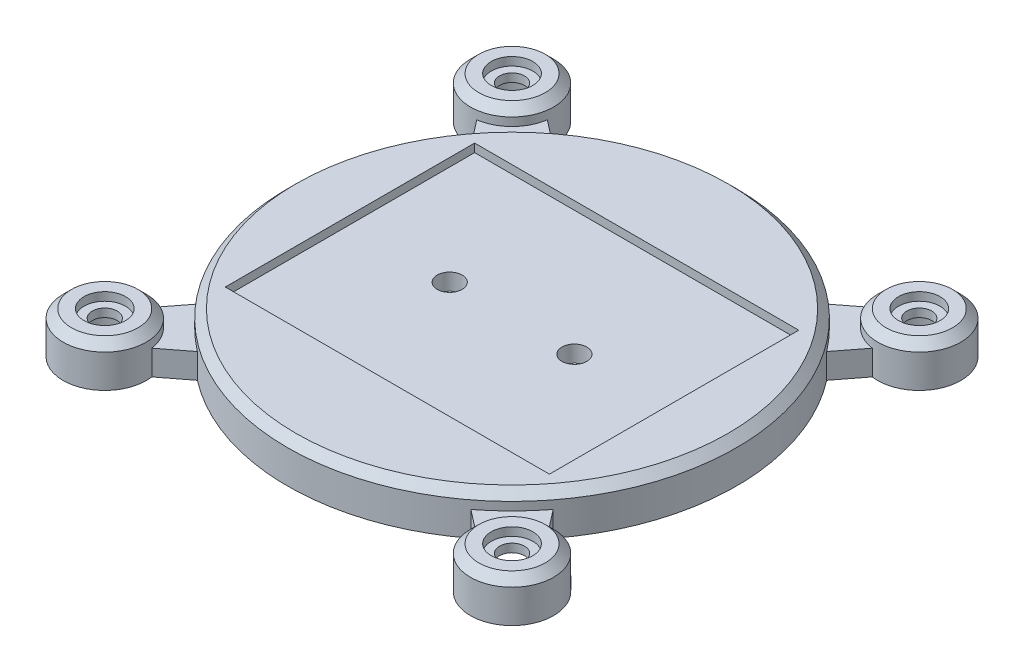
ISO-10303-21;
HEADER;
FILE_DESCRIPTION(('STEP AP214'),'2;1');
FILE_NAME('part.step','',(''),(''),'','','');
FILE_SCHEMA(('AUTOMOTIVE_DESIGN { 1 0 10303 214 1 1 1 1 }'));
ENDSEC;
DATA;
#1=APPLICATION_CONTEXT('core data for automotive mechanical design processes');
#2=APPLICATION_PROTOCOL_DEFINITION('international standard','automotive_design',2000,#1);
#3=PRODUCT_CONTEXT('',#1,'mechanical');
#4=PRODUCT('Part','Part','',(#3));
#5=PRODUCT_RELATED_PRODUCT_CATEGORY('part','',(#4));
#6=PRODUCT_DEFINITION_FORMATION('','',#4);
#7=PRODUCT_DEFINITION_CONTEXT('part definition',#1,'design');
#8=PRODUCT_DEFINITION('design','',#6,#7);
#9=PRODUCT_DEFINITION_SHAPE('','',#8);
#10=(LENGTH_UNIT() NAMED_UNIT(*) SI_UNIT(.MILLI.,.METRE.));
#11=(NAMED_UNIT(*) PLANE_ANGLE_UNIT() SI_UNIT($,.RADIAN.));
#12=(NAMED_UNIT(*) SI_UNIT($,.STERADIAN.) SOLID_ANGLE_UNIT());
#13=UNCERTAINTY_MEASURE_WITH_UNIT(LENGTH_MEASURE(1.E-05),#10,'distance_accuracy_value','');
#14=(GEOMETRIC_REPRESENTATION_CONTEXT(3) GLOBAL_UNCERTAINTY_ASSIGNED_CONTEXT((#13)) GLOBAL_UNIT_ASSIGNED_CONTEXT((#10,
#11,#12)) REPRESENTATION_CONTEXT('',''));
#15=CARTESIAN_POINT('',(0.,0.,0.));
#16=DIRECTION('',(0.,0.,1.));
#17=DIRECTION('',(1.,0.,0.));
#18=AXIS2_PLACEMENT_3D('',#15,#16,#17);
#19=CARTESIAN_POINT('',(-24.5,5.,24.5));
#20=DIRECTION('',(0.,1.,0.));
#21=DIRECTION('',(0.,0.,1.));
#22=AXIS2_PLACEMENT_3D('',#19,#20,#21);
#23=CYLINDRICAL_SURFACE('',#22,2.499999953);
#24=CARTESIAN_POINT('',(-24.5,3.999999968,24.5));
#25=DIRECTION('',(0.,1.,0.));
#26=DIRECTION('',(0.,0.,1.));
#27=AXIS2_PLACEMENT_3D('',#24,#25,#26);
#28=CIRCLE('',#27,2.499999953);
#29=CARTESIAN_POINT('',(-24.5,3.999999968,26.999999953));
#30=VERTEX_POINT('',#29);
#31=EDGE_CURVE('E448',#30,#30,#28,.F.);
#32=ORIENTED_EDGE('',*,*,#31,.T.);
#33=EDGE_LOOP('',(#32));
#34=FACE_BOUND('',#33,.T.);
#35=CARTESIAN_POINT('',(-24.5,5.,24.5));
#36=DIRECTION('',(0.,1.,0.));
#37=DIRECTION('',(0.,0.,1.));
#38=AXIS2_PLACEMENT_3D('',#35,#36,#37);
#39=CIRCLE('',#38,2.499999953);
#40=CARTESIAN_POINT('',(-24.5,5.,26.999999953));
#41=VERTEX_POINT('',#40);
#42=EDGE_CURVE('E451',#41,#41,#39,.F.);
#43=ORIENTED_EDGE('',*,*,#42,.F.);
#44=EDGE_LOOP('',(#43));
#45=FACE_BOUND('',#44,.T.);
#46=ADVANCED_FACE('F17',(#34,#45),#23,.F.);
#47=CARTESIAN_POINT('',(24.5,5.,24.5));
#48=DIRECTION('',(0.,1.,0.));
#49=DIRECTION('',(0.,0.,1.));
#50=AXIS2_PLACEMENT_3D('',#47,#48,#49);
#51=CYLINDRICAL_SURFACE('',#50,2.499999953);
#52=CARTESIAN_POINT('',(24.5,3.999999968,24.5));
#53=DIRECTION('',(0.,1.,0.));
#54=DIRECTION('',(0.,0.,1.));
#55=AXIS2_PLACEMENT_3D('',#52,#53,#54);
#56=CIRCLE('',#55,2.499999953);
#57=CARTESIAN_POINT('',(24.5,3.999999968,26.999999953));
#58=VERTEX_POINT('',#57);
#59=EDGE_CURVE('E445',#58,#58,#56,.F.);
#60=ORIENTED_EDGE('',*,*,#59,.T.);
#61=EDGE_LOOP('',(#60));
#62=FACE_BOUND('',#61,.T.);
#63=CARTESIAN_POINT('',(24.5,5.,24.5));
#64=DIRECTION('',(0.,1.,0.));
#65=DIRECTION('',(0.,0.,1.));
#66=AXIS2_PLACEMENT_3D('',#63,#64,#65);
#67=CIRCLE('',#66,2.499999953);
#68=CARTESIAN_POINT('',(24.5,5.,26.999999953));
#69=VERTEX_POINT('',#68);
#70=EDGE_CURVE('E20',#69,#69,#67,.F.);
#71=ORIENTED_EDGE('',*,*,#70,.F.);
#72=EDGE_LOOP('',(#71));
#73=FACE_BOUND('',#72,.T.);
#74=ADVANCED_FACE('F466',(#62,#73),#51,.F.);
#75=CARTESIAN_POINT('',(24.5,5.,-24.5));
#76=DIRECTION('',(0.,1.,0.));
#77=DIRECTION('',(0.,0.,1.));
#78=AXIS2_PLACEMENT_3D('',#75,#76,#77);
#79=CYLINDRICAL_SURFACE('',#78,2.499999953);
#80=CARTESIAN_POINT('',(24.5,3.999999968,-24.5));
#81=DIRECTION('',(0.,1.,0.));
#82=DIRECTION('',(0.,0.,1.));
#83=AXIS2_PLACEMENT_3D('',#80,#81,#82);
#84=CIRCLE('',#83,2.499999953);
#85=CARTESIAN_POINT('',(24.5,3.999999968,-22.000000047));
#86=VERTEX_POINT('',#85);
#87=EDGE_CURVE('E442',#86,#86,#84,.F.);
#88=ORIENTED_EDGE('',*,*,#87,.T.);
#89=EDGE_LOOP('',(#88));
#90=FACE_BOUND('',#89,.T.);
#91=CARTESIAN_POINT('',(24.5,5.,-24.5));
#92=DIRECTION('',(0.,1.,0.));
#93=DIRECTION('',(0.,0.,1.));
#94=AXIS2_PLACEMENT_3D('',#91,#92,#93);
#95=CIRCLE('',#94,2.499999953);
#96=CARTESIAN_POINT('',(24.5,5.,-22.000000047));
#97=VERTEX_POINT('',#96);
#98=EDGE_CURVE('E456',#97,#97,#95,.F.);
#99=ORIENTED_EDGE('',*,*,#98,.F.);
#100=EDGE_LOOP('',(#99));
#101=FACE_BOUND('',#100,.T.);
#102=ADVANCED_FACE('F468',(#90,#101),#79,.F.);
#103=CARTESIAN_POINT('',(-24.5,5.,-24.5));
#104=DIRECTION('',(0.,1.,0.));
#105=DIRECTION('',(0.,0.,1.));
#106=AXIS2_PLACEMENT_3D('',#103,#104,#105);
#107=CYLINDRICAL_SURFACE('',#106,2.499999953);
#108=CARTESIAN_POINT('',(-24.5,3.999999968,-24.5));
#109=DIRECTION('',(0.,1.,0.));
#110=DIRECTION('',(0.,0.,1.));
#111=AXIS2_PLACEMENT_3D('',#108,#109,#110);
#112=CIRCLE('',#111,2.499999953);
#113=CARTESIAN_POINT('',(-24.5,3.999999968,-22.000000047));
#114=VERTEX_POINT('',#113);
#115=EDGE_CURVE('E439',#114,#114,#112,.F.);
#116=ORIENTED_EDGE('',*,*,#115,.T.);
#117=EDGE_LOOP('',(#116));
#118=FACE_BOUND('',#117,.T.);
#119=CARTESIAN_POINT('',(-24.5,5.,-24.5));
#120=DIRECTION('',(0.,1.,0.));
#121=DIRECTION('',(0.,0.,1.));
#122=AXIS2_PLACEMENT_3D('',#119,#120,#121);
#123=CIRCLE('',#122,2.499999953);
#124=CARTESIAN_POINT('',(-24.5,5.,-22.000000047));
#125=VERTEX_POINT('',#124);
#126=EDGE_CURVE('E454',#125,#125,#123,.F.);
#127=ORIENTED_EDGE('',*,*,#126,.F.);
#128=EDGE_LOOP('',(#127));
#129=FACE_BOUND('',#128,.T.);
#130=ADVANCED_FACE('F475',(#118,#129),#107,.F.);
#131=CARTESIAN_POINT('',(0.,5.,0.));
#132=DIRECTION('',(0.,1.,0.));
#133=DIRECTION('',(0.,0.,1.));
#134=AXIS2_PLACEMENT_3D('',#131,#132,#133);
#135=PLANE('',#134);
#136=ORIENTED_EDGE('',*,*,#70,.T.);
#137=EDGE_LOOP('',(#136));
#138=FACE_BOUND('',#137,.T.);
#139=CARTESIAN_POINT('',(24.5,5.0000000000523,24.5));
#140=DIRECTION('',(0.,-1.,0.));
#141=DIRECTION('',(0.,0.,-1.));
#142=AXIS2_PLACEMENT_3D('',#139,#140,#141);
#143=CIRCLE('',#142,3.99999999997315);
#144=CARTESIAN_POINT('',(24.5,5.0000000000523,20.5000000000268));
#145=VERTEX_POINT('',#144);
#146=EDGE_CURVE('E436',#145,#145,#143,.T.);
#147=ORIENTED_EDGE('',*,*,#146,.F.);
#148=EDGE_LOOP('',(#147));
#149=FACE_BOUND('',#148,.T.);
#150=ADVANCED_FACE('F463',(#138,#149),#135,.T.);
#151=CARTESIAN_POINT('',(0.,5.,0.));
#152=DIRECTION('',(0.,1.,0.));
#153=DIRECTION('',(0.,0.,1.));
#154=AXIS2_PLACEMENT_3D('',#151,#152,#153);
#155=PLANE('',#154);
#156=ORIENTED_EDGE('',*,*,#98,.T.);
#157=EDGE_LOOP('',(#156));
#158=FACE_BOUND('',#157,.T.);
#159=CARTESIAN_POINT('',(24.5,4.99999999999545,-24.5));
#160=DIRECTION('',(0.,-1.,0.));
#161=DIRECTION('',(0.,0.,-1.));
#162=AXIS2_PLACEMENT_3D('',#159,#160,#161);
#163=CIRCLE('',#162,4.0000000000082);
#164=CARTESIAN_POINT('',(24.5,4.99999999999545,-28.5000000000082));
#165=VERTEX_POINT('',#164);
#166=EDGE_CURVE('E433',#165,#165,#163,.T.);
#167=ORIENTED_EDGE('',*,*,#166,.F.);
#168=EDGE_LOOP('',(#167));
#169=FACE_BOUND('',#168,.T.);
#170=ADVANCED_FACE('F756',(#158,#169),#155,.T.);
#171=CARTESIAN_POINT('',(0.,5.,0.));
#172=DIRECTION('',(0.,1.,0.));
#173=DIRECTION('',(0.,0.,1.));
#174=AXIS2_PLACEMENT_3D('',#171,#172,#173);
#175=PLANE('',#174);
#176=ORIENTED_EDGE('',*,*,#126,.T.);
#177=EDGE_LOOP('',(#176));
#178=FACE_BOUND('',#177,.T.);
#179=CARTESIAN_POINT('',(-24.5,5.0000000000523,-24.5));
#180=DIRECTION('',(0.,-1.,0.));
#181=DIRECTION('',(0.,0.,-1.));
#182=AXIS2_PLACEMENT_3D('',#179,#180,#181);
#183=CIRCLE('',#182,3.99999999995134);
#184=CARTESIAN_POINT('',(-24.5,5.0000000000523,-28.4999999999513));
#185=VERTEX_POINT('',#184);
#186=EDGE_CURVE('E430',#185,#185,#183,.T.);
#187=ORIENTED_EDGE('',*,*,#186,.F.);
#188=EDGE_LOOP('',(#187));
#189=FACE_BOUND('',#188,.T.);
#190=ADVANCED_FACE('F752',(#178,#189),#175,.T.);
#191=CARTESIAN_POINT('',(0.,5.,0.));
#192=DIRECTION('',(0.,1.,0.));
#193=DIRECTION('',(0.,0.,1.));
#194=AXIS2_PLACEMENT_3D('',#191,#192,#193);
#195=PLANE('',#194);
#196=ORIENTED_EDGE('',*,*,#42,.T.);
#197=EDGE_LOOP('',(#196));
#198=FACE_BOUND('',#197,.T.);
#199=CARTESIAN_POINT('',(-24.5,5.0000000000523,24.5));
#200=DIRECTION('',(0.,-1.,0.));
#201=DIRECTION('',(0.,0.,-1.));
#202=AXIS2_PLACEMENT_3D('',#199,#200,#201);
#203=CIRCLE('',#202,4.00000000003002);
#204=CARTESIAN_POINT('',(-24.5,5.0000000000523,20.49999999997));
#205=VERTEX_POINT('',#204);
#206=EDGE_CURVE('E427',#205,#205,#203,.T.);
#207=ORIENTED_EDGE('',*,*,#206,.F.);
#208=EDGE_LOOP('',(#207));
#209=FACE_BOUND('',#208,.T.);
#210=ADVANCED_FACE('F748',(#198,#209),#195,.T.);
#211=CARTESIAN_POINT('',(-22.999999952,3.999999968,24.5));
#212=DIRECTION('',(0.,-1.,0.));
#213=DIRECTION('',(0.,0.,-1.));
#214=AXIS2_PLACEMENT_3D('',#211,#212,#213);
#215=PLANE('',#214);
#216=ORIENTED_EDGE('',*,*,#31,.F.);
#217=EDGE_LOOP('',(#216));
#218=FACE_BOUND('',#217,.T.);
#219=CARTESIAN_POINT('',(-24.5,3.999999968,24.5));
#220=DIRECTION('',(0.,1.,0.));
#221=DIRECTION('',(0.,0.,1.));
#222=AXIS2_PLACEMENT_3D('',#219,#220,#221);
#223=CIRCLE('',#222,1.500000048);
#224=CARTESIAN_POINT('',(-24.5,3.999999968,26.000000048));
#225=VERTEX_POINT('',#224);
#226=EDGE_CURVE('E421',#225,#225,#223,.F.);
#227=ORIENTED_EDGE('',*,*,#226,.T.);
#228=EDGE_LOOP('',(#227));
#229=FACE_BOUND('',#228,.T.);
#230=ADVANCED_FACE('F744',(#218,#229),#215,.F.);
#231=CARTESIAN_POINT('',(26.000000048,3.999999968,24.5));
#232=DIRECTION('',(0.,-1.,0.));
#233=DIRECTION('',(0.,0.,-1.));
#234=AXIS2_PLACEMENT_3D('',#231,#232,#233);
#235=PLANE('',#234);
#236=ORIENTED_EDGE('',*,*,#59,.F.);
#237=EDGE_LOOP('',(#236));
#238=FACE_BOUND('',#237,.T.);
#239=CARTESIAN_POINT('',(24.5,3.999999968,24.5));
#240=DIRECTION('',(0.,1.,0.));
#241=DIRECTION('',(0.,0.,1.));
#242=AXIS2_PLACEMENT_3D('',#239,#240,#241);
#243=CIRCLE('',#242,1.500000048);
#244=CARTESIAN_POINT('',(24.5,3.999999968,26.000000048));
#245=VERTEX_POINT('',#244);
#246=EDGE_CURVE('E418',#245,#245,#243,.F.);
#247=ORIENTED_EDGE('',*,*,#246,.T.);
#248=EDGE_LOOP('',(#247));
#249=FACE_BOUND('',#248,.T.);
#250=ADVANCED_FACE('F740',(#238,#249),#235,.F.);
#251=CARTESIAN_POINT('',(26.000000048,3.999999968,-24.5));
#252=DIRECTION('',(0.,-1.,0.));
#253=DIRECTION('',(0.,0.,-1.));
#254=AXIS2_PLACEMENT_3D('',#251,#252,#253);
#255=PLANE('',#254);
#256=ORIENTED_EDGE('',*,*,#87,.F.);
#257=EDGE_LOOP('',(#256));
#258=FACE_BOUND('',#257,.T.);
#259=CARTESIAN_POINT('',(24.5,3.999999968,-24.5));
#260=DIRECTION('',(0.,1.,0.));
#261=DIRECTION('',(0.,0.,1.));
#262=AXIS2_PLACEMENT_3D('',#259,#260,#261);
#263=CIRCLE('',#262,1.500000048);
#264=CARTESIAN_POINT('',(24.5,3.999999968,-22.999999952));
#265=VERTEX_POINT('',#264);
#266=EDGE_CURVE('E415',#265,#265,#263,.F.);
#267=ORIENTED_EDGE('',*,*,#266,.T.);
#268=EDGE_LOOP('',(#267));
#269=FACE_BOUND('',#268,.T.);
#270=ADVANCED_FACE('F736',(#258,#269),#255,.F.);
#271=CARTESIAN_POINT('',(-22.999999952,3.999999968,-24.5));
#272=DIRECTION('',(0.,-1.,0.));
#273=DIRECTION('',(0.,0.,-1.));
#274=AXIS2_PLACEMENT_3D('',#271,#272,#273);
#275=PLANE('',#274);
#276=ORIENTED_EDGE('',*,*,#115,.F.);
#277=EDGE_LOOP('',(#276));
#278=FACE_BOUND('',#277,.T.);
#279=CARTESIAN_POINT('',(-24.5,3.999999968,-24.5));
#280=DIRECTION('',(0.,1.,0.));
#281=DIRECTION('',(0.,0.,1.));
#282=AXIS2_PLACEMENT_3D('',#279,#280,#281);
#283=CIRCLE('',#282,1.500000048);
#284=CARTESIAN_POINT('',(-24.5,3.999999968,-22.999999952));
#285=VERTEX_POINT('',#284);
#286=EDGE_CURVE('E190',#285,#285,#283,.F.);
#287=ORIENTED_EDGE('',*,*,#286,.T.);
#288=EDGE_LOOP('',(#287));
#289=FACE_BOUND('',#288,.T.);
#290=ADVANCED_FACE('F732',(#278,#289),#275,.F.);
#291=CARTESIAN_POINT('',(24.5,4.0000000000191,24.5));
#292=DIRECTION('',(0.,-1.,0.));
#293=DIRECTION('',(0.,0.,-1.));
#294=AXIS2_PLACEMENT_3D('',#291,#292,#293);
#295=CONICAL_SURFACE('',#294,4.99999999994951,0.785398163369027);
#296=CARTESIAN_POINT('',(24.5,4.,24.5));
#297=DIRECTION('',(0.,-1.,0.));
#298=DIRECTION('',(0.,0.,-1.));
#299=AXIS2_PLACEMENT_3D('',#296,#297,#298);
#300=CIRCLE('',#299,5.);
#301=CARTESIAN_POINT('',(24.5,4.,19.5));
#302=VERTEX_POINT('',#301);
#303=EDGE_CURVE('E195',#302,#302,#300,.T.);
#304=ORIENTED_EDGE('',*,*,#303,.F.);
#305=EDGE_LOOP('',(#304));
#306=FACE_BOUND('',#305,.T.);
#307=ORIENTED_EDGE('',*,*,#146,.T.);
#308=EDGE_LOOP('',(#307));
#309=FACE_BOUND('',#308,.T.);
#310=ADVANCED_FACE('F728',(#306,#309),#295,.T.);
#311=CARTESIAN_POINT('',(24.5,4.00000000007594,-24.5));
#312=DIRECTION('',(0.,-1.,0.));
#313=DIRECTION('',(0.,0.,-1.));
#314=AXIS2_PLACEMENT_3D('',#311,#312,#313);
#315=CONICAL_SURFACE('',#314,4.9999999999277,0.785398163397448);
#316=ORIENTED_EDGE('',*,*,#166,.T.);
#317=EDGE_LOOP('',(#316));
#318=FACE_BOUND('',#317,.T.);
#319=CARTESIAN_POINT('',(24.5,3.99999999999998,-24.5));
#320=DIRECTION('',(0.,-1.,0.));
#321=DIRECTION('',(0.,0.,-1.));
#322=AXIS2_PLACEMENT_3D('',#319,#320,#321);
#323=CIRCLE('',#322,5.);
#324=CARTESIAN_POINT('',(24.5,3.99999999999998,-29.5));
#325=VERTEX_POINT('',#324);
#326=EDGE_CURVE('E239',#325,#325,#323,.T.);
#327=ORIENTED_EDGE('',*,*,#326,.F.);
#328=EDGE_LOOP('',(#327));
#329=FACE_BOUND('',#328,.T.);
#330=ADVANCED_FACE('F725',(#318,#329),#315,.T.);
#331=CARTESIAN_POINT('',(0.,3.,0.));
#332=DIRECTION('',(0.,1.,0.));
#333=DIRECTION('',(0.,0.,1.));
#334=AXIS2_PLACEMENT_3D('',#331,#332,#333);
#335=PLANE('',#334);
#336=CARTESIAN_POINT('',(0.,3.,0.));
#337=DIRECTION('',(0.,-1.,0.));
#338=DIRECTION('',(0.,0.,-1.));
#339=AXIS2_PLACEMENT_3D('',#336,#337,#338);
#340=CIRCLE('',#339,27.);
#341=CARTESIAN_POINT('',(16.4559212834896,3.,21.4056687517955));
#342=VERTEX_POINT('',#341);
#343=CARTESIAN_POINT('',(21.4056687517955,3.,16.4559212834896));
#344=VERTEX_POINT('',#343);
#345=EDGE_CURVE('E186',#342,#344,#340,.F.);
#346=ORIENTED_EDGE('',*,*,#345,.F.);
#347=DIRECTION('',(-0.791761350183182,0.,-0.610830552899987));
#348=VECTOR('',#347,1.);
#349=CARTESIAN_POINT('',(-4.2125328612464,3.,5.46030431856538));
#350=LINE('',#349,#348);
#351=CARTESIAN_POINT('',(19.5502525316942,3.,23.7928932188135));
#352=VERTEX_POINT('',#351);
#353=EDGE_CURVE('E182',#342,#352,#350,.F.);
#354=ORIENTED_EDGE('',*,*,#353,.T.);
#355=CARTESIAN_POINT('',(24.5,3.,24.5));
#356=DIRECTION('',(0.,-1.,0.));
#357=DIRECTION('',(0.,0.,-1.));
#358=AXIS2_PLACEMENT_3D('',#355,#356,#357);
#359=CIRCLE('',#358,5.);
#360=CARTESIAN_POINT('',(23.7928932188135,3.,19.5502525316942));
#361=VERTEX_POINT('',#360);
#362=EDGE_CURVE('E170',#361,#352,#359,.F.);
#363=ORIENTED_EDGE('',*,*,#362,.F.);
#364=DIRECTION('',(-0.610830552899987,0.,-0.791761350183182));
#365=VECTOR('',#364,1.);
#366=CARTESIAN_POINT('',(5.46030431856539,3.,-4.21253286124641));
#367=LINE('',#366,#365);
#368=EDGE_CURVE('E198',#344,#361,#367,.F.);
#369=ORIENTED_EDGE('',*,*,#368,.F.);
#370=EDGE_LOOP('',(#346,#354,#363,#369));
#371=FACE_BOUND('',#370,.T.);
#372=ADVANCED_FACE('F185',(#371),#335,.T.);
#373=CARTESIAN_POINT('',(0.,3.,0.));
#374=DIRECTION('',(0.,1.,0.));
#375=DIRECTION('',(0.,0.,1.));
#376=AXIS2_PLACEMENT_3D('',#373,#374,#375);
#377=PLANE('',#376);
#378=DIRECTION('',(-0.791761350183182,0.,0.610830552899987));
#379=VECTOR('',#378,1.);
#380=CARTESIAN_POINT('',(-4.21253286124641,3.,-5.46030431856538));
#381=LINE('',#380,#379);
#382=CARTESIAN_POINT('',(16.4559212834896,3.,-21.4056687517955));
#383=VERTEX_POINT('',#382);
#384=CARTESIAN_POINT('',(19.5502525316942,3.,-23.7928932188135));
#385=VERTEX_POINT('',#384);
#386=EDGE_CURVE('E233',#383,#385,#381,.F.);
#387=ORIENTED_EDGE('',*,*,#386,.F.);
#388=CARTESIAN_POINT('',(0.,3.,0.));
#389=DIRECTION('',(0.,-1.,0.));
#390=DIRECTION('',(0.,0.,-1.));
#391=AXIS2_PLACEMENT_3D('',#388,#389,#390);
#392=CIRCLE('',#391,27.);
#393=CARTESIAN_POINT('',(21.4056687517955,3.,-16.4559212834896));
#394=VERTEX_POINT('',#393);
#395=EDGE_CURVE('E407',#394,#383,#392,.F.);
#396=ORIENTED_EDGE('',*,*,#395,.F.);
#397=DIRECTION('',(-0.610830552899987,0.,0.791761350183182));
#398=VECTOR('',#397,1.);
#399=CARTESIAN_POINT('',(5.46030431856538,3.,4.21253286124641));
#400=LINE('',#399,#398);
#401=CARTESIAN_POINT('',(23.7928932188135,3.,-19.5502525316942));
#402=VERTEX_POINT('',#401);
#403=EDGE_CURVE('E236',#394,#402,#400,.F.);
#404=ORIENTED_EDGE('',*,*,#403,.T.);
#405=CARTESIAN_POINT('',(24.5,3.,-24.5));
#406=DIRECTION('',(0.,-1.,0.));
#407=DIRECTION('',(0.,0.,-1.));
#408=AXIS2_PLACEMENT_3D('',#405,#406,#407);
#409=CIRCLE('',#408,5.);
#410=EDGE_CURVE('E242',#385,#402,#409,.F.);
#411=ORIENTED_EDGE('',*,*,#410,.F.);
#412=EDGE_LOOP('',(#387,#396,#404,#411));
#413=FACE_BOUND('',#412,.T.);
#414=ADVANCED_FACE('F718',(#413),#377,.T.);
#415=CARTESIAN_POINT('',(-24.5,3.99999999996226,-24.5));
#416=DIRECTION('',(0.,-1.,0.));
#417=DIRECTION('',(0.,0.,-1.));
#418=AXIS2_PLACEMENT_3D('',#415,#416,#417);
#419=CONICAL_SURFACE('',#418,5.00000000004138,0.785398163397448);
#420=ORIENTED_EDGE('',*,*,#186,.T.);
#421=EDGE_LOOP('',(#420));
#422=FACE_BOUND('',#421,.T.);
#423=CARTESIAN_POINT('',(-24.5,4.,-24.5));
#424=DIRECTION('',(0.,-1.,0.));
#425=DIRECTION('',(0.,0.,-1.));
#426=AXIS2_PLACEMENT_3D('',#423,#424,#425);
#427=CIRCLE('',#426,5.);
#428=CARTESIAN_POINT('',(-24.5,4.,-29.5));
#429=VERTEX_POINT('',#428);
#430=EDGE_CURVE('E217',#429,#429,#427,.T.);
#431=ORIENTED_EDGE('',*,*,#430,.F.);
#432=EDGE_LOOP('',(#431));
#433=FACE_BOUND('',#432,.T.);
#434=ADVANCED_FACE('F714',(#422,#433),#419,.T.);
#435=CARTESIAN_POINT('',(-24.5,4.0000000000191,24.5));
#436=DIRECTION('',(0.,-1.,0.));
#437=DIRECTION('',(0.,0.,-1.));
#438=AXIS2_PLACEMENT_3D('',#435,#436,#437);
#439=CONICAL_SURFACE('',#438,5.00000000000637,0.785398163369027);
#440=CARTESIAN_POINT('',(-24.5,4.,24.5));
#441=DIRECTION('',(0.,-1.,0.));
#442=DIRECTION('',(0.,0.,-1.));
#443=AXIS2_PLACEMENT_3D('',#440,#441,#442);
#444=CIRCLE('',#443,5.);
#445=CARTESIAN_POINT('',(-24.5,4.,19.5));
#446=VERTEX_POINT('',#445);
#447=EDGE_CURVE('E213',#446,#446,#444,.T.);
#448=ORIENTED_EDGE('',*,*,#447,.F.);
#449=EDGE_LOOP('',(#448));
#450=FACE_BOUND('',#449,.T.);
#451=ORIENTED_EDGE('',*,*,#206,.T.);
#452=EDGE_LOOP('',(#451));
#453=FACE_BOUND('',#452,.T.);
#454=ADVANCED_FACE('F710',(#450,#453),#439,.T.);
#455=CARTESIAN_POINT('',(0.,4.,0.));
#456=DIRECTION('',(0.,-1.,0.));
#457=DIRECTION('',(0.,0.,-1.));
#458=AXIS2_PLACEMENT_3D('',#455,#456,#457);
#459=CONICAL_SURFACE('',#458,27.,0.785398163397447);
#460=CARTESIAN_POINT('',(0.,5.,0.));
#461=DIRECTION('',(0.,-1.,0.));
#462=DIRECTION('',(0.,0.,-1.));
#463=AXIS2_PLACEMENT_3D('',#460,#461,#462);
#464=CIRCLE('',#463,26.);
#465=CARTESIAN_POINT('',(0.,5.,-26.));
#466=VERTEX_POINT('',#465);
#467=EDGE_CURVE('E424',#466,#466,#464,.F.);
#468=ORIENTED_EDGE('',*,*,#467,.F.);
#469=EDGE_LOOP('',(#468));
#470=FACE_BOUND('',#469,.T.);
#471=CARTESIAN_POINT('',(0.,4.,0.));
#472=DIRECTION('',(0.,-1.,0.));
#473=DIRECTION('',(0.,0.,-1.));
#474=AXIS2_PLACEMENT_3D('',#471,#472,#473);
#475=CIRCLE('',#474,27.);
#476=CARTESIAN_POINT('',(0.,4.,-27.));
#477=VERTEX_POINT('',#476);
#478=EDGE_CURVE('E223',#477,#477,#475,.T.);
#479=ORIENTED_EDGE('',*,*,#478,.F.);
#480=EDGE_LOOP('',(#479));
#481=FACE_BOUND('',#480,.T.);
#482=ADVANCED_FACE('F706',(#470,#481),#459,.T.);
#483=CARTESIAN_POINT('',(0.,3.,0.));
#484=DIRECTION('',(0.,1.,0.));
#485=DIRECTION('',(0.,0.,1.));
#486=AXIS2_PLACEMENT_3D('',#483,#484,#485);
#487=PLANE('',#486);
#488=CARTESIAN_POINT('',(0.,3.,0.));
#489=DIRECTION('',(0.,-1.,0.));
#490=DIRECTION('',(0.,0.,-1.));
#491=AXIS2_PLACEMENT_3D('',#488,#489,#490);
#492=CIRCLE('',#491,27.);
#493=CARTESIAN_POINT('',(-16.4559212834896,3.,-21.4056687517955));
#494=VERTEX_POINT('',#493);
#495=CARTESIAN_POINT('',(-21.4056687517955,3.,-16.4559212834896));
#496=VERTEX_POINT('',#495);
#497=EDGE_CURVE('E402',#494,#496,#492,.F.);
#498=ORIENTED_EDGE('',*,*,#497,.F.);
#499=DIRECTION('',(0.791761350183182,0.,0.610830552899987));
#500=VECTOR('',#499,1.);
#501=CARTESIAN_POINT('',(4.21253286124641,3.,-5.46030431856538));
#502=LINE('',#501,#500);
#503=CARTESIAN_POINT('',(-19.5502525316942,3.,-23.7928932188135));
#504=VERTEX_POINT('',#503);
#505=EDGE_CURVE('E218',#494,#504,#502,.F.);
#506=ORIENTED_EDGE('',*,*,#505,.T.);
#507=CARTESIAN_POINT('',(-24.5,3.,-24.5));
#508=DIRECTION('',(0.,-1.,0.));
#509=DIRECTION('',(0.,0.,-1.));
#510=AXIS2_PLACEMENT_3D('',#507,#508,#509);
#511=CIRCLE('',#510,5.);
#512=CARTESIAN_POINT('',(-23.7928932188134,3.,-19.5502525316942));
#513=VERTEX_POINT('',#512);
#514=EDGE_CURVE('E221',#513,#504,#511,.F.);
#515=ORIENTED_EDGE('',*,*,#514,.F.);
#516=DIRECTION('',(0.610830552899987,0.,0.791761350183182));
#517=VECTOR('',#516,1.);
#518=CARTESIAN_POINT('',(-5.46030431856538,3.,4.21253286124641));
#519=LINE('',#518,#517);
#520=EDGE_CURVE('E215',#496,#513,#519,.F.);
#521=ORIENTED_EDGE('',*,*,#520,.F.);
#522=EDGE_LOOP('',(#498,#506,#515,#521));
#523=FACE_BOUND('',#522,.T.);
#524=ADVANCED_FACE('F702',(#523),#487,.T.);
#525=CARTESIAN_POINT('',(0.,3.,0.));
#526=DIRECTION('',(0.,1.,0.));
#527=DIRECTION('',(0.,0.,1.));
#528=AXIS2_PLACEMENT_3D('',#525,#526,#527);
#529=PLANE('',#528);
#530=DIRECTION('',(0.791761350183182,0.,-0.610830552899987));
#531=VECTOR('',#530,1.);
#532=CARTESIAN_POINT('',(4.21253286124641,3.,5.46030431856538));
#533=LINE('',#532,#531);
#534=CARTESIAN_POINT('',(-16.4559212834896,3.,21.4056687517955));
#535=VERTEX_POINT('',#534);
#536=CARTESIAN_POINT('',(-19.5502525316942,3.,23.7928932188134));
#537=VERTEX_POINT('',#536);
#538=EDGE_CURVE('E206',#535,#537,#533,.F.);
#539=ORIENTED_EDGE('',*,*,#538,.F.);
#540=CARTESIAN_POINT('',(0.,3.,0.));
#541=DIRECTION('',(0.,-1.,0.));
#542=DIRECTION('',(0.,0.,-1.));
#543=AXIS2_PLACEMENT_3D('',#540,#541,#542);
#544=CIRCLE('',#543,27.);
#545=CARTESIAN_POINT('',(-21.4056687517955,3.,16.4559212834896));
#546=VERTEX_POINT('',#545);
#547=EDGE_CURVE('E398',#546,#535,#544,.F.);
#548=ORIENTED_EDGE('',*,*,#547,.F.);
#549=DIRECTION('',(0.610830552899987,0.,-0.791761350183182));
#550=VECTOR('',#549,1.);
#551=CARTESIAN_POINT('',(-5.46030431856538,3.,-4.2125328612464));
#552=LINE('',#551,#550);
#553=CARTESIAN_POINT('',(-23.7928932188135,3.,19.5502525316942));
#554=VERTEX_POINT('',#553);
#555=EDGE_CURVE('E210',#546,#554,#552,.F.);
#556=ORIENTED_EDGE('',*,*,#555,.T.);
#557=CARTESIAN_POINT('',(-24.5,3.,24.5));
#558=DIRECTION('',(0.,-1.,0.));
#559=DIRECTION('',(0.,0.,-1.));
#560=AXIS2_PLACEMENT_3D('',#557,#558,#559);
#561=CIRCLE('',#560,5.);
#562=EDGE_CURVE('E229',#537,#554,#561,.F.);
#563=ORIENTED_EDGE('',*,*,#562,.F.);
#564=EDGE_LOOP('',(#539,#548,#556,#563));
#565=FACE_BOUND('',#564,.T.);
#566=ADVANCED_FACE('F698',(#565),#529,.T.);
#567=CARTESIAN_POINT('',(0.,5.,0.));
#568=DIRECTION('',(0.,1.,0.));
#569=DIRECTION('',(0.,0.,1.));
#570=AXIS2_PLACEMENT_3D('',#567,#568,#569);
#571=PLANE('',#570);
#572=DIRECTION('',(0.,0.,1.));
#573=VECTOR('',#572,1.);
#574=CARTESIAN_POINT('',(-19.5,5.,15.));
#575=LINE('',#574,#573);
#576=CARTESIAN_POINT('',(-19.5,5.,15.));
#577=VERTEX_POINT('',#576);
#578=CARTESIAN_POINT('',(-19.5,5.,-15.));
#579=VERTEX_POINT('',#578);
#580=EDGE_CURVE('E859',#577,#579,#575,.F.);
#581=ORIENTED_EDGE('',*,*,#580,.T.);
#582=DIRECTION('',(-1.,0.,0.));
#583=VECTOR('',#582,1.);
#584=CARTESIAN_POINT('',(-19.5,5.,-15.));
#585=LINE('',#584,#583);
#586=CARTESIAN_POINT('',(19.5,5.,-15.));
#587=VERTEX_POINT('',#586);
#588=EDGE_CURVE('E853',#579,#587,#585,.F.);
#589=ORIENTED_EDGE('',*,*,#588,.T.);
#590=DIRECTION('',(0.,0.,-1.));
#591=VECTOR('',#590,1.);
#592=CARTESIAN_POINT('',(19.5,5.,15.));
#593=LINE('',#592,#591);
#594=CARTESIAN_POINT('',(19.5,5.,15.));
#595=VERTEX_POINT('',#594);
#596=EDGE_CURVE('E397',#587,#595,#593,.F.);
#597=ORIENTED_EDGE('',*,*,#596,.T.);
#598=DIRECTION('',(1.,0.,0.));
#599=VECTOR('',#598,1.);
#600=CARTESIAN_POINT('',(-19.5,5.,15.));
#601=LINE('',#600,#599);
#602=EDGE_CURVE('E865',#595,#577,#601,.F.);
#603=ORIENTED_EDGE('',*,*,#602,.T.);
#604=EDGE_LOOP('',(#581,#589,#597,#603));
#605=FACE_BOUND('',#604,.T.);
#606=ORIENTED_EDGE('',*,*,#467,.T.);
#607=EDGE_LOOP('',(#606));
#608=FACE_BOUND('',#607,.T.);
#609=ADVANCED_FACE('F694',(#605,#608),#571,.T.);
#610=CARTESIAN_POINT('',(-24.5,5.,24.5));
#611=DIRECTION('',(0.,1.,0.));
#612=DIRECTION('',(0.,0.,1.));
#613=AXIS2_PLACEMENT_3D('',#610,#611,#612);
#614=CYLINDRICAL_SURFACE('',#613,1.500000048);
#615=ORIENTED_EDGE('',*,*,#226,.F.);
#616=EDGE_LOOP('',(#615));
#617=FACE_BOUND('',#616,.T.);
#618=CARTESIAN_POINT('',(-24.5,2.999999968,24.5));
#619=DIRECTION('',(0.,1.,0.));
#620=DIRECTION('',(0.,0.,1.));
#621=AXIS2_PLACEMENT_3D('',#618,#619,#620);
#622=CIRCLE('',#621,1.500000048);
#623=CARTESIAN_POINT('',(-24.5,2.999999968,26.000000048));
#624=VERTEX_POINT('',#623);
#625=EDGE_CURVE('E394',#624,#624,#622,.T.);
#626=ORIENTED_EDGE('',*,*,#625,.F.);
#627=EDGE_LOOP('',(#626));
#628=FACE_BOUND('',#627,.T.);
#629=ADVANCED_FACE('F690',(#617,#628),#614,.F.);
#630=CARTESIAN_POINT('',(24.5,5.,24.5));
#631=DIRECTION('',(0.,1.,0.));
#632=DIRECTION('',(0.,0.,1.));
#633=AXIS2_PLACEMENT_3D('',#630,#631,#632);
#634=CYLINDRICAL_SURFACE('',#633,1.500000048);
#635=ORIENTED_EDGE('',*,*,#246,.F.);
#636=EDGE_LOOP('',(#635));
#637=FACE_BOUND('',#636,.T.);
#638=CARTESIAN_POINT('',(24.5,2.999999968,24.5));
#639=DIRECTION('',(0.,1.,0.));
#640=DIRECTION('',(0.,0.,1.));
#641=AXIS2_PLACEMENT_3D('',#638,#639,#640);
#642=CIRCLE('',#641,1.500000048);
#643=CARTESIAN_POINT('',(24.5,2.999999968,26.000000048));
#644=VERTEX_POINT('',#643);
#645=EDGE_CURVE('E391',#644,#644,#642,.T.);
#646=ORIENTED_EDGE('',*,*,#645,.F.);
#647=EDGE_LOOP('',(#646));
#648=FACE_BOUND('',#647,.T.);
#649=ADVANCED_FACE('F686',(#637,#648),#634,.F.);
#650=CARTESIAN_POINT('',(24.5,5.,-24.5));
#651=DIRECTION('',(0.,1.,0.));
#652=DIRECTION('',(0.,0.,1.));
#653=AXIS2_PLACEMENT_3D('',#650,#651,#652);
#654=CYLINDRICAL_SURFACE('',#653,1.500000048);
#655=ORIENTED_EDGE('',*,*,#266,.F.);
#656=EDGE_LOOP('',(#655));
#657=FACE_BOUND('',#656,.T.);
#658=CARTESIAN_POINT('',(24.5,2.999999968,-24.5));
#659=DIRECTION('',(0.,1.,0.));
#660=DIRECTION('',(0.,0.,1.));
#661=AXIS2_PLACEMENT_3D('',#658,#659,#660);
#662=CIRCLE('',#661,1.500000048);
#663=CARTESIAN_POINT('',(24.5,2.999999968,-22.999999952));
#664=VERTEX_POINT('',#663);
#665=EDGE_CURVE('E382',#664,#664,#662,.T.);
#666=ORIENTED_EDGE('',*,*,#665,.F.);
#667=EDGE_LOOP('',(#666));
#668=FACE_BOUND('',#667,.T.);
#669=ADVANCED_FACE('F682',(#657,#668),#654,.F.);
#670=CARTESIAN_POINT('',(-24.5,5.,-24.5));
#671=DIRECTION('',(0.,1.,0.));
#672=DIRECTION('',(0.,0.,1.));
#673=AXIS2_PLACEMENT_3D('',#670,#671,#672);
#674=CYLINDRICAL_SURFACE('',#673,1.500000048);
#675=ORIENTED_EDGE('',*,*,#286,.F.);
#676=EDGE_LOOP('',(#675));
#677=FACE_BOUND('',#676,.T.);
#678=CARTESIAN_POINT('',(-24.5,2.999999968,-24.5));
#679=DIRECTION('',(0.,1.,0.));
#680=DIRECTION('',(0.,0.,1.));
#681=AXIS2_PLACEMENT_3D('',#678,#679,#680);
#682=CIRCLE('',#681,1.500000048);
#683=CARTESIAN_POINT('',(-24.5,2.999999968,-22.999999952));
#684=VERTEX_POINT('',#683);
#685=EDGE_CURVE('E379',#684,#684,#682,.T.);
#686=ORIENTED_EDGE('',*,*,#685,.F.);
#687=EDGE_LOOP('',(#686));
#688=FACE_BOUND('',#687,.T.);
#689=ADVANCED_FACE('F679',(#677,#688),#674,.F.);
#690=CARTESIAN_POINT('',(-4.2125328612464,3.,5.46030431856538));
#691=DIRECTION('',(0.610830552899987,0.,-0.791761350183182));
#692=DIRECTION('',(-0.791761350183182,0.,-0.610830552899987));
#693=AXIS2_PLACEMENT_3D('',#690,#691,#692);
#694=PLANE('',#693);
#695=DIRECTION('',(0.,-1.,0.));
#696=VECTOR('',#695,1.);
#697=CARTESIAN_POINT('',(19.5502525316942,5.,23.7928932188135));
#698=LINE('',#697,#696);
#699=CARTESIAN_POINT('',(19.5502525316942,0.,23.7928932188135));
#700=VERTEX_POINT('',#699);
#701=EDGE_CURVE('E176',#352,#700,#698,.T.);
#702=ORIENTED_EDGE('',*,*,#701,.F.);
#703=ORIENTED_EDGE('',*,*,#353,.F.);
#704=DIRECTION('',(0.,-1.,0.));
#705=VECTOR('',#704,1.);
#706=CARTESIAN_POINT('',(16.4559212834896,5.,21.4056687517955));
#707=LINE('',#706,#705);
#708=CARTESIAN_POINT('',(16.4559212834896,0.,21.4056687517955));
#709=VERTEX_POINT('',#708);
#710=EDGE_CURVE('E203',#709,#342,#707,.F.);
#711=ORIENTED_EDGE('',*,*,#710,.F.);
#712=DIRECTION('',(0.791761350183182,0.,0.610830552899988));
#713=VECTOR('',#712,1.);
#714=CARTESIAN_POINT('',(16.4559212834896,0.,21.4056687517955));
#715=LINE('',#714,#713);
#716=EDGE_CURVE('E194',#709,#700,#715,.T.);
#717=ORIENTED_EDGE('',*,*,#716,.T.);
#718=EDGE_LOOP('',(#702,#703,#711,#717));
#719=FACE_BOUND('',#718,.T.);
#720=ADVANCED_FACE('F192',(#719),#694,.F.);
#721=CARTESIAN_POINT('',(24.5,5.,24.5));
#722=DIRECTION('',(0.,-1.,0.));
#723=DIRECTION('',(0.,0.,-1.));
#724=AXIS2_PLACEMENT_3D('',#721,#722,#723);
#725=CYLINDRICAL_SURFACE('',#724,5.);
#726=ORIENTED_EDGE('',*,*,#701,.T.);
#727=CARTESIAN_POINT('',(24.5,0.,24.5));
#728=DIRECTION('',(0.,-1.,0.));
#729=DIRECTION('',(0.,0.,-1.));
#730=AXIS2_PLACEMENT_3D('',#727,#728,#729);
#731=CIRCLE('',#730,5.);
#732=CARTESIAN_POINT('',(23.7928932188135,0.,19.5502525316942));
#733=VERTEX_POINT('',#732);
#734=EDGE_CURVE('E374',#700,#733,#731,.F.);
#735=ORIENTED_EDGE('',*,*,#734,.T.);
#736=DIRECTION('',(0.,1.,0.));
#737=VECTOR('',#736,1.);
#738=CARTESIAN_POINT('',(23.7928932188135,3.,19.5502525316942));
#739=LINE('',#738,#737);
#740=EDGE_CURVE('E179',#361,#733,#739,.F.);
#741=ORIENTED_EDGE('',*,*,#740,.F.);
#742=ORIENTED_EDGE('',*,*,#362,.T.);
#743=EDGE_LOOP('',(#726,#735,#741,#742));
#744=FACE_BOUND('',#743,.T.);
#745=ORIENTED_EDGE('',*,*,#303,.T.);
#746=EDGE_LOOP('',(#745));
#747=FACE_BOUND('',#746,.T.);
#748=ADVANCED_FACE('F172',(#744,#747),#725,.T.);
#749=CARTESIAN_POINT('',(5.46030431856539,3.,-4.21253286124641));
#750=DIRECTION('',(0.791761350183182,0.,-0.610830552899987));
#751=DIRECTION('',(-0.610830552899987,0.,-0.791761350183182));
#752=AXIS2_PLACEMENT_3D('',#749,#750,#751);
#753=PLANE('',#752);
#754=ORIENTED_EDGE('',*,*,#368,.T.);
#755=ORIENTED_EDGE('',*,*,#740,.T.);
#756=DIRECTION('',(-0.610830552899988,0.,-0.791761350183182));
#757=VECTOR('',#756,1.);
#758=CARTESIAN_POINT('',(23.7928932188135,0.,19.5502525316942));
#759=LINE('',#758,#757);
#760=CARTESIAN_POINT('',(21.4056687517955,0.,16.4559212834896));
#761=VERTEX_POINT('',#760);
#762=EDGE_CURVE('E373',#733,#761,#759,.T.);
#763=ORIENTED_EDGE('',*,*,#762,.T.);
#764=DIRECTION('',(0.,-1.,0.));
#765=VECTOR('',#764,1.);
#766=CARTESIAN_POINT('',(21.4056687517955,5.,16.4559212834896));
#767=LINE('',#766,#765);
#768=EDGE_CURVE('E411',#344,#761,#767,.T.);
#769=ORIENTED_EDGE('',*,*,#768,.F.);
#770=EDGE_LOOP('',(#754,#755,#763,#769));
#771=FACE_BOUND('',#770,.T.);
#772=ADVANCED_FACE('F670',(#771),#753,.T.);
#773=CARTESIAN_POINT('',(5.46030431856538,3.,4.21253286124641));
#774=DIRECTION('',(-0.791761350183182,0.,-0.610830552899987));
#775=DIRECTION('',(-0.610830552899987,0.,0.791761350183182));
#776=AXIS2_PLACEMENT_3D('',#773,#774,#775);
#777=PLANE('',#776);
#778=DIRECTION('',(0.,-1.,0.));
#779=VECTOR('',#778,1.);
#780=CARTESIAN_POINT('',(23.7928932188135,5.,-19.5502525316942));
#781=LINE('',#780,#779);
#782=CARTESIAN_POINT('',(23.7928932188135,0.,-19.5502525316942));
#783=VERTEX_POINT('',#782);
#784=EDGE_CURVE('E235',#402,#783,#781,.T.);
#785=ORIENTED_EDGE('',*,*,#784,.F.);
#786=ORIENTED_EDGE('',*,*,#403,.F.);
#787=DIRECTION('',(0.,-1.,0.));
#788=VECTOR('',#787,1.);
#789=CARTESIAN_POINT('',(21.4056687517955,5.,-16.4559212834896));
#790=LINE('',#789,#788);
#791=CARTESIAN_POINT('',(21.4056687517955,0.,-16.4559212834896));
#792=VERTEX_POINT('',#791);
#793=EDGE_CURVE('E409',#792,#394,#790,.F.);
#794=ORIENTED_EDGE('',*,*,#793,.F.);
#795=DIRECTION('',(0.610830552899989,0.,-0.791761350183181));
#796=VECTOR('',#795,1.);
#797=CARTESIAN_POINT('',(21.4056687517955,0.,-16.4559212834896));
#798=LINE('',#797,#796);
#799=EDGE_CURVE('E369',#792,#783,#798,.T.);
#800=ORIENTED_EDGE('',*,*,#799,.T.);
#801=EDGE_LOOP('',(#785,#786,#794,#800));
#802=FACE_BOUND('',#801,.T.);
#803=ADVANCED_FACE('F666',(#802),#777,.F.);
#804=CARTESIAN_POINT('',(24.5,5.,-24.5));
#805=DIRECTION('',(0.,-1.,0.));
#806=DIRECTION('',(0.,0.,-1.));
#807=AXIS2_PLACEMENT_3D('',#804,#805,#806);
#808=CYLINDRICAL_SURFACE('',#807,5.);
#809=ORIENTED_EDGE('',*,*,#326,.T.);
#810=EDGE_LOOP('',(#809));
#811=FACE_BOUND('',#810,.T.);
#812=ORIENTED_EDGE('',*,*,#784,.T.);
#813=CARTESIAN_POINT('',(24.5,0.,-24.5));
#814=DIRECTION('',(0.,-1.,0.));
#815=DIRECTION('',(0.,0.,-1.));
#816=AXIS2_PLACEMENT_3D('',#813,#814,#815);
#817=CIRCLE('',#816,5.);
#818=CARTESIAN_POINT('',(19.5502525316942,0.,-23.7928932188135));
#819=VERTEX_POINT('',#818);
#820=EDGE_CURVE('E366',#783,#819,#817,.F.);
#821=ORIENTED_EDGE('',*,*,#820,.T.);
#822=DIRECTION('',(0.,1.,0.));
#823=VECTOR('',#822,1.);
#824=CARTESIAN_POINT('',(19.5502525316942,3.,-23.7928932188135));
#825=LINE('',#824,#823);
#826=EDGE_CURVE('E205',#385,#819,#825,.F.);
#827=ORIENTED_EDGE('',*,*,#826,.F.);
#828=ORIENTED_EDGE('',*,*,#410,.T.);
#829=EDGE_LOOP('',(#812,#821,#827,#828));
#830=FACE_BOUND('',#829,.T.);
#831=ADVANCED_FACE('F662',(#811,#830),#808,.T.);
#832=CARTESIAN_POINT('',(-4.21253286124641,3.,-5.46030431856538));
#833=DIRECTION('',(-0.610830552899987,0.,-0.791761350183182));
#834=DIRECTION('',(-0.791761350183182,0.,0.610830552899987));
#835=AXIS2_PLACEMENT_3D('',#832,#833,#834);
#836=PLANE('',#835);
#837=ORIENTED_EDGE('',*,*,#386,.T.);
#838=ORIENTED_EDGE('',*,*,#826,.T.);
#839=DIRECTION('',(-0.791761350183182,0.,0.610830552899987));
#840=VECTOR('',#839,1.);
#841=CARTESIAN_POINT('',(19.5502525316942,0.,-23.7928932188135));
#842=LINE('',#841,#840);
#843=CARTESIAN_POINT('',(16.4559212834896,0.,-21.4056687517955));
#844=VERTEX_POINT('',#843);
#845=EDGE_CURVE('E365',#819,#844,#842,.T.);
#846=ORIENTED_EDGE('',*,*,#845,.T.);
#847=DIRECTION('',(0.,-1.,0.));
#848=VECTOR('',#847,1.);
#849=CARTESIAN_POINT('',(16.4559212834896,5.,-21.4056687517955));
#850=LINE('',#849,#848);
#851=EDGE_CURVE('E222',#383,#844,#850,.T.);
#852=ORIENTED_EDGE('',*,*,#851,.F.);
#853=EDGE_LOOP('',(#837,#838,#846,#852));
#854=FACE_BOUND('',#853,.T.);
#855=ADVANCED_FACE('F658',(#854),#836,.T.);
#856=CARTESIAN_POINT('',(4.21253286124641,3.,-5.46030431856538));
#857=DIRECTION('',(-0.610830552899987,0.,0.791761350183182));
#858=DIRECTION('',(0.791761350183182,0.,0.610830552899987));
#859=AXIS2_PLACEMENT_3D('',#856,#857,#858);
#860=PLANE('',#859);
#861=DIRECTION('',(0.,-1.,0.));
#862=VECTOR('',#861,1.);
#863=CARTESIAN_POINT('',(-19.5502525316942,5.,-23.7928932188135));
#864=LINE('',#863,#862);
#865=CARTESIAN_POINT('',(-19.5502525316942,0.,-23.7928932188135));
#866=VERTEX_POINT('',#865);
#867=EDGE_CURVE('E232',#504,#866,#864,.T.);
#868=ORIENTED_EDGE('',*,*,#867,.F.);
#869=ORIENTED_EDGE('',*,*,#505,.F.);
#870=DIRECTION('',(0.,-1.,0.));
#871=VECTOR('',#870,1.);
#872=CARTESIAN_POINT('',(-16.4559212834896,5.,-21.4056687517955));
#873=LINE('',#872,#871);
#874=CARTESIAN_POINT('',(-16.4559212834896,0.,-21.4056687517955));
#875=VERTEX_POINT('',#874);
#876=EDGE_CURVE('E226',#875,#494,#873,.F.);
#877=ORIENTED_EDGE('',*,*,#876,.F.);
#878=DIRECTION('',(-0.791761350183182,0.,-0.610830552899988));
#879=VECTOR('',#878,1.);
#880=CARTESIAN_POINT('',(-16.4559212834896,0.,-21.4056687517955));
#881=LINE('',#880,#879);
#882=EDGE_CURVE('E361',#875,#866,#881,.T.);
#883=ORIENTED_EDGE('',*,*,#882,.T.);
#884=EDGE_LOOP('',(#868,#869,#877,#883));
#885=FACE_BOUND('',#884,.T.);
#886=ADVANCED_FACE('F654',(#885),#860,.F.);
#887=CARTESIAN_POINT('',(-24.5,5.,-24.5));
#888=DIRECTION('',(0.,-1.,0.));
#889=DIRECTION('',(0.,0.,-1.));
#890=AXIS2_PLACEMENT_3D('',#887,#888,#889);
#891=CYLINDRICAL_SURFACE('',#890,5.);
#892=ORIENTED_EDGE('',*,*,#430,.T.);
#893=EDGE_LOOP('',(#892));
#894=FACE_BOUND('',#893,.T.);
#895=CARTESIAN_POINT('',(-24.5,0.,-24.5));
#896=DIRECTION('',(0.,-1.,0.));
#897=DIRECTION('',(0.,0.,-1.));
#898=AXIS2_PLACEMENT_3D('',#895,#896,#897);
#899=CIRCLE('',#898,5.);
#900=CARTESIAN_POINT('',(-23.7928932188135,0.,-19.5502525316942));
#901=VERTEX_POINT('',#900);
#902=EDGE_CURVE('E359',#866,#901,#899,.F.);
#903=ORIENTED_EDGE('',*,*,#902,.T.);
#904=DIRECTION('',(0.,1.,0.));
#905=VECTOR('',#904,1.);
#906=CARTESIAN_POINT('',(-23.7928932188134,3.,-19.5502525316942));
#907=LINE('',#906,#905);
#908=EDGE_CURVE('E214',#513,#901,#907,.F.);
#909=ORIENTED_EDGE('',*,*,#908,.F.);
#910=ORIENTED_EDGE('',*,*,#514,.T.);
#911=ORIENTED_EDGE('',*,*,#867,.T.);
#912=EDGE_LOOP('',(#903,#909,#910,#911));
#913=FACE_BOUND('',#912,.T.);
#914=ADVANCED_FACE('F650',(#894,#913),#891,.T.);
#915=CARTESIAN_POINT('',(-5.46030431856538,3.,4.21253286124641));
#916=DIRECTION('',(-0.791761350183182,0.,0.610830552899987));
#917=DIRECTION('',(0.610830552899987,0.,0.791761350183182));
#918=AXIS2_PLACEMENT_3D('',#915,#916,#917);
#919=PLANE('',#918);
#920=ORIENTED_EDGE('',*,*,#520,.T.);
#921=ORIENTED_EDGE('',*,*,#908,.T.);
#922=DIRECTION('',(0.610830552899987,0.,0.791761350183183));
#923=VECTOR('',#922,1.);
#924=CARTESIAN_POINT('',(-23.7928932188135,0.,-19.5502525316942));
#925=LINE('',#924,#923);
#926=CARTESIAN_POINT('',(-21.4056687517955,0.,-16.4559212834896));
#927=VERTEX_POINT('',#926);
#928=EDGE_CURVE('E358',#901,#927,#925,.T.);
#929=ORIENTED_EDGE('',*,*,#928,.T.);
#930=DIRECTION('',(0.,-1.,0.));
#931=VECTOR('',#930,1.);
#932=CARTESIAN_POINT('',(-21.4056687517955,5.,-16.4559212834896));
#933=LINE('',#932,#931);
#934=EDGE_CURVE('E404',#496,#927,#933,.T.);
#935=ORIENTED_EDGE('',*,*,#934,.F.);
#936=EDGE_LOOP('',(#920,#921,#929,#935));
#937=FACE_BOUND('',#936,.T.);
#938=ADVANCED_FACE('F646',(#937),#919,.T.);
#939=CARTESIAN_POINT('',(-5.46030431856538,3.,-4.2125328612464));
#940=DIRECTION('',(0.791761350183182,0.,0.610830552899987));
#941=DIRECTION('',(0.610830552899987,0.,-0.791761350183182));
#942=AXIS2_PLACEMENT_3D('',#939,#940,#941);
#943=PLANE('',#942);
#944=DIRECTION('',(0.,-1.,0.));
#945=VECTOR('',#944,1.);
#946=CARTESIAN_POINT('',(-23.7928932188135,5.,19.5502525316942));
#947=LINE('',#946,#945);
#948=CARTESIAN_POINT('',(-23.7928932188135,0.,19.5502525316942));
#949=VERTEX_POINT('',#948);
#950=EDGE_CURVE('E209',#554,#949,#947,.T.);
#951=ORIENTED_EDGE('',*,*,#950,.F.);
#952=ORIENTED_EDGE('',*,*,#555,.F.);
#953=DIRECTION('',(0.,-1.,0.));
#954=VECTOR('',#953,1.);
#955=CARTESIAN_POINT('',(-21.4056687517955,5.,16.4559212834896));
#956=LINE('',#955,#954);
#957=CARTESIAN_POINT('',(-21.4056687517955,0.,16.4559212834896));
#958=VERTEX_POINT('',#957);
#959=EDGE_CURVE('E401',#958,#546,#956,.F.);
#960=ORIENTED_EDGE('',*,*,#959,.F.);
#961=DIRECTION('',(-0.610830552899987,0.,0.791761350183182));
#962=VECTOR('',#961,1.);
#963=CARTESIAN_POINT('',(-21.4056687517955,0.,16.4559212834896));
#964=LINE('',#963,#962);
#965=EDGE_CURVE('E354',#958,#949,#964,.T.);
#966=ORIENTED_EDGE('',*,*,#965,.T.);
#967=EDGE_LOOP('',(#951,#952,#960,#966));
#968=FACE_BOUND('',#967,.T.);
#969=ADVANCED_FACE('F642',(#968),#943,.F.);
#970=CARTESIAN_POINT('',(-24.5,5.,24.5));
#971=DIRECTION('',(0.,-1.,0.));
#972=DIRECTION('',(0.,0.,-1.));
#973=AXIS2_PLACEMENT_3D('',#970,#971,#972);
#974=CYLINDRICAL_SURFACE('',#973,5.);
#975=ORIENTED_EDGE('',*,*,#950,.T.);
#976=CARTESIAN_POINT('',(-24.5,0.,24.5));
#977=DIRECTION('',(0.,-1.,0.));
#978=DIRECTION('',(0.,0.,-1.));
#979=AXIS2_PLACEMENT_3D('',#976,#977,#978);
#980=CIRCLE('',#979,5.);
#981=CARTESIAN_POINT('',(-19.5502525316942,0.,23.7928932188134));
#982=VERTEX_POINT('',#981);
#983=EDGE_CURVE('E351',#949,#982,#980,.F.);
#984=ORIENTED_EDGE('',*,*,#983,.T.);
#985=DIRECTION('',(0.,1.,0.));
#986=VECTOR('',#985,1.);
#987=CARTESIAN_POINT('',(-19.5502525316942,3.,23.7928932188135));
#988=LINE('',#987,#986);
#989=EDGE_CURVE('E208',#537,#982,#988,.F.);
#990=ORIENTED_EDGE('',*,*,#989,.F.);
#991=ORIENTED_EDGE('',*,*,#562,.T.);
#992=EDGE_LOOP('',(#975,#984,#990,#991));
#993=FACE_BOUND('',#992,.T.);
#994=ORIENTED_EDGE('',*,*,#447,.T.);
#995=EDGE_LOOP('',(#994));
#996=FACE_BOUND('',#995,.T.);
#997=ADVANCED_FACE('F638',(#993,#996),#974,.T.);
#998=CARTESIAN_POINT('',(4.21253286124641,3.,5.46030431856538));
#999=DIRECTION('',(0.610830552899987,0.,0.791761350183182));
#1000=DIRECTION('',(0.791761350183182,0.,-0.610830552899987));
#1001=AXIS2_PLACEMENT_3D('',#998,#999,#1000);
#1002=PLANE('',#1001);
#1003=ORIENTED_EDGE('',*,*,#538,.T.);
#1004=ORIENTED_EDGE('',*,*,#989,.T.);
#1005=DIRECTION('',(0.791761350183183,0.,-0.610830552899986));
#1006=VECTOR('',#1005,1.);
#1007=CARTESIAN_POINT('',(-19.5502525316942,0.,23.7928932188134));
#1008=LINE('',#1007,#1006);
#1009=CARTESIAN_POINT('',(-16.4559212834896,0.,21.4056687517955));
#1010=VERTEX_POINT('',#1009);
#1011=EDGE_CURVE('E350',#982,#1010,#1008,.T.);
#1012=ORIENTED_EDGE('',*,*,#1011,.T.);
#1013=DIRECTION('',(0.,-1.,0.));
#1014=VECTOR('',#1013,1.);
#1015=CARTESIAN_POINT('',(-16.4559212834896,5.,21.4056687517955));
#1016=LINE('',#1015,#1014);
#1017=EDGE_CURVE('E400',#535,#1010,#1016,.T.);
#1018=ORIENTED_EDGE('',*,*,#1017,.F.);
#1019=EDGE_LOOP('',(#1003,#1004,#1012,#1018));
#1020=FACE_BOUND('',#1019,.T.);
#1021=ADVANCED_FACE('F634',(#1020),#1002,.T.);
#1022=CARTESIAN_POINT('',(0.,5.,0.));
#1023=DIRECTION('',(0.,-1.,0.));
#1024=DIRECTION('',(0.,0.,-1.));
#1025=AXIS2_PLACEMENT_3D('',#1022,#1023,#1024);
#1026=CYLINDRICAL_SURFACE('',#1025,27.);
#1027=ORIENTED_EDGE('',*,*,#478,.T.);
#1028=EDGE_LOOP('',(#1027));
#1029=FACE_BOUND('',#1028,.T.);
#1030=ORIENTED_EDGE('',*,*,#1017,.T.);
#1031=CARTESIAN_POINT('',(0.,0.,0.));
#1032=DIRECTION('',(0.,-1.,0.));
#1033=DIRECTION('',(0.,0.,-1.));
#1034=AXIS2_PLACEMENT_3D('',#1031,#1032,#1033);
#1035=CIRCLE('',#1034,27.);
#1036=EDGE_CURVE('E348',#1010,#709,#1035,.F.);
#1037=ORIENTED_EDGE('',*,*,#1036,.T.);
#1038=ORIENTED_EDGE('',*,*,#710,.T.);
#1039=ORIENTED_EDGE('',*,*,#345,.T.);
#1040=ORIENTED_EDGE('',*,*,#768,.T.);
#1041=CARTESIAN_POINT('',(0.,0.,0.));
#1042=DIRECTION('',(0.,-1.,0.));
#1043=DIRECTION('',(0.,0.,-1.));
#1044=AXIS2_PLACEMENT_3D('',#1041,#1042,#1043);
#1045=CIRCLE('',#1044,27.);
#1046=EDGE_CURVE('E370',#761,#792,#1045,.F.);
#1047=ORIENTED_EDGE('',*,*,#1046,.T.);
#1048=ORIENTED_EDGE('',*,*,#793,.T.);
#1049=ORIENTED_EDGE('',*,*,#395,.T.);
#1050=ORIENTED_EDGE('',*,*,#851,.T.);
#1051=CARTESIAN_POINT('',(0.,0.,0.));
#1052=DIRECTION('',(0.,-1.,0.));
#1053=DIRECTION('',(0.,0.,-1.));
#1054=AXIS2_PLACEMENT_3D('',#1051,#1052,#1053);
#1055=CIRCLE('',#1054,27.);
#1056=EDGE_CURVE('E362',#844,#875,#1055,.F.);
#1057=ORIENTED_EDGE('',*,*,#1056,.T.);
#1058=ORIENTED_EDGE('',*,*,#876,.T.);
#1059=ORIENTED_EDGE('',*,*,#497,.T.);
#1060=ORIENTED_EDGE('',*,*,#934,.T.);
#1061=CARTESIAN_POINT('',(0.,0.,0.));
#1062=DIRECTION('',(0.,-1.,0.));
#1063=DIRECTION('',(0.,0.,-1.));
#1064=AXIS2_PLACEMENT_3D('',#1061,#1062,#1063);
#1065=CIRCLE('',#1064,27.);
#1066=EDGE_CURVE('E355',#927,#958,#1065,.F.);
#1067=ORIENTED_EDGE('',*,*,#1066,.T.);
#1068=ORIENTED_EDGE('',*,*,#959,.T.);
#1069=ORIENTED_EDGE('',*,*,#547,.T.);
#1070=EDGE_LOOP('',(#1030,#1037,#1038,#1039,#1040,#1047,#1048,#1049,#1050,#1057,#1058,#1059,
#1060,#1067,#1068,#1069));
#1071=FACE_BOUND('',#1070,.T.);
#1072=ADVANCED_FACE('F630',(#1029,#1071),#1026,.T.);
#1073=CARTESIAN_POINT('',(-19.5,4.,15.));
#1074=DIRECTION('',(0.,0.,1.));
#1075=DIRECTION('',(1.,0.,0.));
#1076=AXIS2_PLACEMENT_3D('',#1073,#1074,#1075);
#1077=PLANE('',#1076);
#1078=DIRECTION('',(0.,1.,0.));
#1079=VECTOR('',#1078,1.);
#1080=CARTESIAN_POINT('',(19.5,4.,15.));
#1081=LINE('',#1080,#1079);
#1082=CARTESIAN_POINT('',(19.5,4.,15.));
#1083=VERTEX_POINT('',#1082);
#1084=EDGE_CURVE('E850',#595,#1083,#1081,.F.);
#1085=ORIENTED_EDGE('',*,*,#1084,.T.);
#1086=DIRECTION('',(1.,0.,0.));
#1087=VECTOR('',#1086,1.);
#1088=CARTESIAN_POINT('',(0.,4.,15.));
#1089=LINE('',#1088,#1087);
#1090=CARTESIAN_POINT('',(-19.5,4.,15.));
#1091=VERTEX_POINT('',#1090);
#1092=EDGE_CURVE('E340',#1083,#1091,#1089,.F.);
#1093=ORIENTED_EDGE('',*,*,#1092,.T.);
#1094=DIRECTION('',(0.,1.,0.));
#1095=VECTOR('',#1094,1.);
#1096=CARTESIAN_POINT('',(-19.5,4.,15.));
#1097=LINE('',#1096,#1095);
#1098=EDGE_CURVE('E862',#1091,#577,#1097,.T.);
#1099=ORIENTED_EDGE('',*,*,#1098,.T.);
#1100=ORIENTED_EDGE('',*,*,#602,.F.);
#1101=EDGE_LOOP('',(#1085,#1093,#1099,#1100));
#1102=FACE_BOUND('',#1101,.T.);
#1103=ADVANCED_FACE('F626',(#1102),#1077,.F.);
#1104=CARTESIAN_POINT('',(-19.5,4.,15.));
#1105=DIRECTION('',(-1.,0.,0.));
#1106=DIRECTION('',(0.,0.,1.));
#1107=AXIS2_PLACEMENT_3D('',#1104,#1105,#1106);
#1108=PLANE('',#1107);
#1109=ORIENTED_EDGE('',*,*,#1098,.F.);
#1110=DIRECTION('',(0.,0.,-1.));
#1111=VECTOR('',#1110,1.);
#1112=CARTESIAN_POINT('',(-19.5,4.,0.));
#1113=LINE('',#1112,#1111);
#1114=CARTESIAN_POINT('',(-19.5,4.,-15.));
#1115=VERTEX_POINT('',#1114);
#1116=EDGE_CURVE('E918',#1091,#1115,#1113,.T.);
#1117=ORIENTED_EDGE('',*,*,#1116,.T.);
#1118=DIRECTION('',(0.,1.,0.));
#1119=VECTOR('',#1118,1.);
#1120=CARTESIAN_POINT('',(-19.5,4.,-15.));
#1121=LINE('',#1120,#1119);
#1122=EDGE_CURVE('E856',#1115,#579,#1121,.T.);
#1123=ORIENTED_EDGE('',*,*,#1122,.T.);
#1124=ORIENTED_EDGE('',*,*,#580,.F.);
#1125=EDGE_LOOP('',(#1109,#1117,#1123,#1124));
#1126=FACE_BOUND('',#1125,.T.);
#1127=ADVANCED_FACE('F622',(#1126),#1108,.F.);
#1128=CARTESIAN_POINT('',(-19.5,4.,-15.));
#1129=DIRECTION('',(0.,0.,-1.));
#1130=DIRECTION('',(-1.,0.,0.));
#1131=AXIS2_PLACEMENT_3D('',#1128,#1129,#1130);
#1132=PLANE('',#1131);
#1133=ORIENTED_EDGE('',*,*,#1122,.F.);
#1134=DIRECTION('',(1.,0.,0.));
#1135=VECTOR('',#1134,1.);
#1136=CARTESIAN_POINT('',(0.,4.,-15.));
#1137=LINE('',#1136,#1135);
#1138=CARTESIAN_POINT('',(19.5,4.,-15.));
#1139=VERTEX_POINT('',#1138);
#1140=EDGE_CURVE('E921',#1115,#1139,#1137,.T.);
#1141=ORIENTED_EDGE('',*,*,#1140,.T.);
#1142=DIRECTION('',(0.,1.,0.));
#1143=VECTOR('',#1142,1.);
#1144=CARTESIAN_POINT('',(19.5,4.,-15.));
#1145=LINE('',#1144,#1143);
#1146=EDGE_CURVE('E847',#1139,#587,#1145,.T.);
#1147=ORIENTED_EDGE('',*,*,#1146,.T.);
#1148=ORIENTED_EDGE('',*,*,#588,.F.);
#1149=EDGE_LOOP('',(#1133,#1141,#1147,#1148));
#1150=FACE_BOUND('',#1149,.T.);
#1151=ADVANCED_FACE('F618',(#1150),#1132,.F.);
#1152=CARTESIAN_POINT('',(19.5,4.,15.));
#1153=DIRECTION('',(1.,0.,0.));
#1154=DIRECTION('',(0.,0.,-1.));
#1155=AXIS2_PLACEMENT_3D('',#1152,#1153,#1154);
#1156=PLANE('',#1155);
#1157=ORIENTED_EDGE('',*,*,#1146,.F.);
#1158=DIRECTION('',(0.,0.,-1.));
#1159=VECTOR('',#1158,1.);
#1160=CARTESIAN_POINT('',(19.5,4.,0.));
#1161=LINE('',#1160,#1159);
#1162=EDGE_CURVE('E336',#1139,#1083,#1161,.F.);
#1163=ORIENTED_EDGE('',*,*,#1162,.T.);
#1164=ORIENTED_EDGE('',*,*,#1084,.F.);
#1165=ORIENTED_EDGE('',*,*,#596,.F.);
#1166=EDGE_LOOP('',(#1157,#1163,#1164,#1165));
#1167=FACE_BOUND('',#1166,.T.);
#1168=ADVANCED_FACE('F614',(#1167),#1156,.F.);
#1169=CARTESIAN_POINT('',(-22.999999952,2.999999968,24.5));
#1170=DIRECTION('',(0.,-1.,0.));
#1171=DIRECTION('',(0.,0.,-1.));
#1172=AXIS2_PLACEMENT_3D('',#1169,#1170,#1171);
#1173=PLANE('',#1172);
#1174=CARTESIAN_POINT('',(-24.5,3.,24.5));
#1175=DIRECTION('',(0.,-1.,0.));
#1176=DIRECTION('',(0.,0.,-1.));
#1177=AXIS2_PLACEMENT_3D('',#1174,#1175,#1176);
#1178=CIRCLE('',#1177,4.);
#1179=CARTESIAN_POINT('',(-24.5,3.,20.5));
#1180=VERTEX_POINT('',#1179);
#1181=EDGE_CURVE('E329',#1180,#1180,#1178,.T.);
#1182=ORIENTED_EDGE('',*,*,#1181,.T.);
#1183=EDGE_LOOP('',(#1182));
#1184=FACE_BOUND('',#1183,.T.);
#1185=ORIENTED_EDGE('',*,*,#625,.T.);
#1186=EDGE_LOOP('',(#1185));
#1187=FACE_BOUND('',#1186,.T.);
#1188=ADVANCED_FACE('F610',(#1184,#1187),#1173,.T.);
#1189=CARTESIAN_POINT('',(0.,3.,0.));
#1190=DIRECTION('',(0.,1.,0.));
#1191=DIRECTION('',(0.,0.,1.));
#1192=AXIS2_PLACEMENT_3D('',#1189,#1190,#1191);
#1193=PLANE('',#1192);
#1194=CARTESIAN_POINT('',(0.,3.,0.));
#1195=DIRECTION('',(0.,-1.,0.));
#1196=DIRECTION('',(0.,0.,-1.));
#1197=AXIS2_PLACEMENT_3D('',#1194,#1195,#1196);
#1198=CIRCLE('',#1197,25.);
#1199=CARTESIAN_POINT('',(19.2093727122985,3.,16.));
#1200=VERTEX_POINT('',#1199);
#1201=CARTESIAN_POINT('',(-19.2093727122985,3.,16.));
#1202=VERTEX_POINT('',#1201);
#1203=EDGE_CURVE('E320',#1200,#1202,#1198,.T.);
#1204=ORIENTED_EDGE('',*,*,#1203,.T.);
#1205=DIRECTION('',(1.,0.,0.));
#1206=VECTOR('',#1205,1.);
#1207=CARTESIAN_POINT('',(-19.5,3.,16.));
#1208=LINE('',#1207,#1206);
#1209=EDGE_CURVE('E838',#1200,#1202,#1208,.F.);
#1210=ORIENTED_EDGE('',*,*,#1209,.F.);
#1211=EDGE_LOOP('',(#1204,#1210));
#1212=FACE_BOUND('',#1211,.T.);
#1213=ADVANCED_FACE('F606',(#1212),#1193,.F.);
#1214=CARTESIAN_POINT('',(26.000000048,2.999999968,24.5));
#1215=DIRECTION('',(0.,-1.,0.));
#1216=DIRECTION('',(0.,0.,-1.));
#1217=AXIS2_PLACEMENT_3D('',#1214,#1215,#1216);
#1218=PLANE('',#1217);
#1219=CARTESIAN_POINT('',(24.5,3.,24.5));
#1220=DIRECTION('',(0.,-1.,0.));
#1221=DIRECTION('',(0.,0.,-1.));
#1222=AXIS2_PLACEMENT_3D('',#1219,#1220,#1221);
#1223=CIRCLE('',#1222,4.);
#1224=CARTESIAN_POINT('',(24.5,3.,20.5));
#1225=VERTEX_POINT('',#1224);
#1226=EDGE_CURVE('E312',#1225,#1225,#1223,.T.);
#1227=ORIENTED_EDGE('',*,*,#1226,.T.);
#1228=EDGE_LOOP('',(#1227));
#1229=FACE_BOUND('',#1228,.T.);
#1230=ORIENTED_EDGE('',*,*,#645,.T.);
#1231=EDGE_LOOP('',(#1230));
#1232=FACE_BOUND('',#1231,.T.);
#1233=ADVANCED_FACE('F602',(#1229,#1232),#1218,.T.);
#1234=CARTESIAN_POINT('',(0.,3.,0.));
#1235=DIRECTION('',(0.,1.,0.));
#1236=DIRECTION('',(0.,0.,1.));
#1237=AXIS2_PLACEMENT_3D('',#1234,#1235,#1236);
#1238=PLANE('',#1237);
#1239=CARTESIAN_POINT('',(0.,3.,0.));
#1240=DIRECTION('',(0.,-1.,0.));
#1241=DIRECTION('',(0.,0.,-1.));
#1242=AXIS2_PLACEMENT_3D('',#1239,#1240,#1241);
#1243=CIRCLE('',#1242,25.);
#1244=CARTESIAN_POINT('',(20.5,3.,-14.3090880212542));
#1245=VERTEX_POINT('',#1244);
#1246=CARTESIAN_POINT('',(20.5,3.,14.3090880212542));
#1247=VERTEX_POINT('',#1246);
#1248=EDGE_CURVE('E387',#1245,#1247,#1243,.T.);
#1249=ORIENTED_EDGE('',*,*,#1248,.T.);
#1250=DIRECTION('',(0.,0.,-1.));
#1251=VECTOR('',#1250,1.);
#1252=CARTESIAN_POINT('',(20.5,3.,15.));
#1253=LINE('',#1252,#1251);
#1254=EDGE_CURVE('E826',#1245,#1247,#1253,.F.);
#1255=ORIENTED_EDGE('',*,*,#1254,.F.);
#1256=EDGE_LOOP('',(#1249,#1255));
#1257=FACE_BOUND('',#1256,.T.);
#1258=ADVANCED_FACE('F598',(#1257),#1238,.F.);
#1259=CARTESIAN_POINT('',(0.,5.,0.));
#1260=DIRECTION('',(0.,-1.,0.));
#1261=DIRECTION('',(0.,0.,-1.));
#1262=AXIS2_PLACEMENT_3D('',#1259,#1260,#1261);
#1263=CYLINDRICAL_SURFACE('',#1262,25.);
#1264=CARTESIAN_POINT('',(0.,0.,0.));
#1265=DIRECTION('',(0.,-1.,0.));
#1266=DIRECTION('',(0.,0.,-1.));
#1267=AXIS2_PLACEMENT_3D('',#1264,#1265,#1266);
#1268=CIRCLE('',#1267,25.);
#1269=CARTESIAN_POINT('',(19.5084879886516,0.,-15.6339021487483));
#1270=VERTEX_POINT('',#1269);
#1271=CARTESIAN_POINT('',(19.5084879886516,0.,15.6339021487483));
#1272=VERTEX_POINT('',#1271);
#1273=EDGE_CURVE('E376',#1270,#1272,#1268,.T.);
#1274=ORIENTED_EDGE('',*,*,#1273,.T.);
#1275=DIRECTION('',(0.,1.,0.));
#1276=VECTOR('',#1275,1.);
#1277=CARTESIAN_POINT('',(19.5084879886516,3.,15.6339021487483));
#1278=LINE('',#1277,#1276);
#1279=CARTESIAN_POINT('',(19.5084879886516,2.,15.6339021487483));
#1280=VERTEX_POINT('',#1279);
#1281=EDGE_CURVE('E315',#1272,#1280,#1278,.T.);
#1282=ORIENTED_EDGE('',*,*,#1281,.T.);
#1283=CARTESIAN_POINT('',(0.,2.,0.));
#1284=DIRECTION('',(0.,-1.,0.));
#1285=DIRECTION('',(0.,0.,-1.));
#1286=AXIS2_PLACEMENT_3D('',#1283,#1284,#1285);
#1287=CIRCLE('',#1286,25.);
#1288=CARTESIAN_POINT('',(20.5,2.,14.3090880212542));
#1289=VERTEX_POINT('',#1288);
#1290=EDGE_CURVE('E385',#1289,#1280,#1287,.T.);
#1291=ORIENTED_EDGE('',*,*,#1290,.F.);
#1292=DIRECTION('',(0.,1.,0.));
#1293=VECTOR('',#1292,1.);
#1294=CARTESIAN_POINT('',(20.5,4.,14.3090880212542));
#1295=LINE('',#1294,#1293);
#1296=EDGE_CURVE('E833',#1247,#1289,#1295,.F.);
#1297=ORIENTED_EDGE('',*,*,#1296,.F.);
#1298=ORIENTED_EDGE('',*,*,#1248,.F.);
#1299=DIRECTION('',(0.,1.,0.));
#1300=VECTOR('',#1299,1.);
#1301=CARTESIAN_POINT('',(20.5,4.,-14.3090880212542));
#1302=LINE('',#1301,#1300);
#1303=CARTESIAN_POINT('',(20.5,2.,-14.3090880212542));
#1304=VERTEX_POINT('',#1303);
#1305=EDGE_CURVE('E829',#1304,#1245,#1302,.T.);
#1306=ORIENTED_EDGE('',*,*,#1305,.F.);
#1307=CARTESIAN_POINT('',(0.,2.,0.));
#1308=DIRECTION('',(0.,-1.,0.));
#1309=DIRECTION('',(0.,0.,-1.));
#1310=AXIS2_PLACEMENT_3D('',#1307,#1308,#1309);
#1311=CIRCLE('',#1310,25.);
#1312=CARTESIAN_POINT('',(19.5084879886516,2.,-15.6339021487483));
#1313=VERTEX_POINT('',#1312);
#1314=EDGE_CURVE('E389',#1313,#1304,#1311,.T.);
#1315=ORIENTED_EDGE('',*,*,#1314,.F.);
#1316=DIRECTION('',(0.,1.,0.));
#1317=VECTOR('',#1316,1.);
#1318=CARTESIAN_POINT('',(19.5084879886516,3.,-15.6339021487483));
#1319=LINE('',#1318,#1317);
#1320=EDGE_CURVE('E825',#1270,#1313,#1319,.T.);
#1321=ORIENTED_EDGE('',*,*,#1320,.F.);
#1322=EDGE_LOOP('',(#1274,#1282,#1291,#1297,#1298,#1306,#1315,#1321));
#1323=FACE_BOUND('',#1322,.T.);
#1324=ADVANCED_FACE('F594',(#1323),#1263,.F.);
#1325=CARTESIAN_POINT('',(26.000000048,2.999999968,-24.5));
#1326=DIRECTION('',(0.,-1.,0.));
#1327=DIRECTION('',(0.,0.,-1.));
#1328=AXIS2_PLACEMENT_3D('',#1325,#1326,#1327);
#1329=PLANE('',#1328);
#1330=CARTESIAN_POINT('',(24.5,3.,-24.5));
#1331=DIRECTION('',(0.,-1.,0.));
#1332=DIRECTION('',(0.,0.,-1.));
#1333=AXIS2_PLACEMENT_3D('',#1330,#1331,#1332);
#1334=CIRCLE('',#1333,4.);
#1335=CARTESIAN_POINT('',(24.5,3.,-28.5));
#1336=VERTEX_POINT('',#1335);
#1337=EDGE_CURVE('E304',#1336,#1336,#1334,.T.);
#1338=ORIENTED_EDGE('',*,*,#1337,.T.);
#1339=EDGE_LOOP('',(#1338));
#1340=FACE_BOUND('',#1339,.T.);
#1341=ORIENTED_EDGE('',*,*,#665,.T.);
#1342=EDGE_LOOP('',(#1341));
#1343=FACE_BOUND('',#1342,.T.);
#1344=ADVANCED_FACE('F590',(#1340,#1343),#1329,.T.);
#1345=CARTESIAN_POINT('',(0.,3.,0.));
#1346=DIRECTION('',(0.,1.,0.));
#1347=DIRECTION('',(0.,0.,1.));
#1348=AXIS2_PLACEMENT_3D('',#1345,#1346,#1347);
#1349=PLANE('',#1348);
#1350=CARTESIAN_POINT('',(0.,3.,0.));
#1351=DIRECTION('',(0.,-1.,0.));
#1352=DIRECTION('',(0.,0.,-1.));
#1353=AXIS2_PLACEMENT_3D('',#1350,#1351,#1352);
#1354=CIRCLE('',#1353,25.);
#1355=CARTESIAN_POINT('',(-19.2093727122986,3.,-16.));
#1356=VERTEX_POINT('',#1355);
#1357=CARTESIAN_POINT('',(19.2093727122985,3.,-16.));
#1358=VERTEX_POINT('',#1357);
#1359=EDGE_CURVE('E295',#1356,#1358,#1354,.T.);
#1360=ORIENTED_EDGE('',*,*,#1359,.T.);
#1361=DIRECTION('',(-1.,0.,0.));
#1362=VECTOR('',#1361,1.);
#1363=CARTESIAN_POINT('',(-19.5,3.,-16.));
#1364=LINE('',#1363,#1362);
#1365=EDGE_CURVE('E303',#1356,#1358,#1364,.F.);
#1366=ORIENTED_EDGE('',*,*,#1365,.F.);
#1367=EDGE_LOOP('',(#1360,#1366));
#1368=FACE_BOUND('',#1367,.T.);
#1369=ADVANCED_FACE('F586',(#1368),#1349,.F.);
#1370=CARTESIAN_POINT('',(-22.999999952,2.999999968,-24.5));
#1371=DIRECTION('',(0.,-1.,0.));
#1372=DIRECTION('',(0.,0.,-1.));
#1373=AXIS2_PLACEMENT_3D('',#1370,#1371,#1372);
#1374=PLANE('',#1373);
#1375=CARTESIAN_POINT('',(-24.5,3.,-24.5));
#1376=DIRECTION('',(0.,-1.,0.));
#1377=DIRECTION('',(0.,0.,-1.));
#1378=AXIS2_PLACEMENT_3D('',#1375,#1376,#1377);
#1379=CIRCLE('',#1378,4.);
#1380=CARTESIAN_POINT('',(-24.5,3.,-28.5));
#1381=VERTEX_POINT('',#1380);
#1382=EDGE_CURVE('E287',#1381,#1381,#1379,.T.);
#1383=ORIENTED_EDGE('',*,*,#1382,.T.);
#1384=EDGE_LOOP('',(#1383));
#1385=FACE_BOUND('',#1384,.T.);
#1386=ORIENTED_EDGE('',*,*,#685,.T.);
#1387=EDGE_LOOP('',(#1386));
#1388=FACE_BOUND('',#1387,.T.);
#1389=ADVANCED_FACE('F582',(#1385,#1388),#1374,.T.);
#1390=CARTESIAN_POINT('',(0.,3.,0.));
#1391=DIRECTION('',(0.,1.,0.));
#1392=DIRECTION('',(0.,0.,1.));
#1393=AXIS2_PLACEMENT_3D('',#1390,#1391,#1392);
#1394=PLANE('',#1393);
#1395=CARTESIAN_POINT('',(0.,3.,0.));
#1396=DIRECTION('',(0.,-1.,0.));
#1397=DIRECTION('',(0.,0.,-1.));
#1398=AXIS2_PLACEMENT_3D('',#1395,#1396,#1397);
#1399=CIRCLE('',#1398,25.);
#1400=CARTESIAN_POINT('',(-20.5,3.,14.3090880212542));
#1401=VERTEX_POINT('',#1400);
#1402=CARTESIAN_POINT('',(-20.5,3.,-14.3090880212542));
#1403=VERTEX_POINT('',#1402);
#1404=EDGE_CURVE('E344',#1401,#1403,#1399,.T.);
#1405=ORIENTED_EDGE('',*,*,#1404,.T.);
#1406=DIRECTION('',(0.,0.,1.));
#1407=VECTOR('',#1406,1.);
#1408=CARTESIAN_POINT('',(-20.5,3.,15.));
#1409=LINE('',#1408,#1407);
#1410=EDGE_CURVE('E802',#1401,#1403,#1409,.F.);
#1411=ORIENTED_EDGE('',*,*,#1410,.F.);
#1412=EDGE_LOOP('',(#1405,#1411));
#1413=FACE_BOUND('',#1412,.T.);
#1414=ADVANCED_FACE('F578',(#1413),#1394,.F.);
#1415=CARTESIAN_POINT('',(0.,0.,0.));
#1416=DIRECTION('',(0.,1.,0.));
#1417=DIRECTION('',(0.,0.,1.));
#1418=AXIS2_PLACEMENT_3D('',#1415,#1416,#1417);
#1419=PLANE('',#1418);
#1420=ORIENTED_EDGE('',*,*,#1011,.F.);
#1421=ORIENTED_EDGE('',*,*,#983,.F.);
#1422=ORIENTED_EDGE('',*,*,#965,.F.);
#1423=ORIENTED_EDGE('',*,*,#1066,.F.);
#1424=ORIENTED_EDGE('',*,*,#928,.F.);
#1425=ORIENTED_EDGE('',*,*,#902,.F.);
#1426=ORIENTED_EDGE('',*,*,#882,.F.);
#1427=ORIENTED_EDGE('',*,*,#1056,.F.);
#1428=ORIENTED_EDGE('',*,*,#845,.F.);
#1429=ORIENTED_EDGE('',*,*,#820,.F.);
#1430=ORIENTED_EDGE('',*,*,#799,.F.);
#1431=ORIENTED_EDGE('',*,*,#1046,.F.);
#1432=ORIENTED_EDGE('',*,*,#762,.F.);
#1433=ORIENTED_EDGE('',*,*,#734,.F.);
#1434=ORIENTED_EDGE('',*,*,#716,.F.);
#1435=ORIENTED_EDGE('',*,*,#1036,.F.);
#1436=EDGE_LOOP('',(#1420,#1421,#1422,#1423,#1424,#1425,#1426,#1427,#1428,#1429,#1430,#1431,
#1432,#1433,#1434,#1435));
#1437=FACE_BOUND('',#1436,.T.);
#1438=CARTESIAN_POINT('',(0.,0.,0.));
#1439=DIRECTION('',(0.,-1.,0.));
#1440=DIRECTION('',(0.,0.,-1.));
#1441=AXIS2_PLACEMENT_3D('',#1438,#1439,#1440);
#1442=CIRCLE('',#1441,25.);
#1443=CARTESIAN_POINT('',(-15.6339021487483,0.,19.5084879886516));
#1444=VERTEX_POINT('',#1443);
#1445=CARTESIAN_POINT('',(15.6339021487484,0.,19.5084879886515));
#1446=VERTEX_POINT('',#1445);
#1447=EDGE_CURVE('E325',#1444,#1446,#1442,.F.);
#1448=ORIENTED_EDGE('',*,*,#1447,.T.);
#1449=DIRECTION('',(-0.791761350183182,0.,-0.610830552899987));
#1450=VECTOR('',#1449,1.);
#1451=CARTESIAN_POINT('',(-3.60170230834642,0.,4.66854296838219));
#1452=LINE('',#1451,#1450);
#1453=CARTESIAN_POINT('',(20.6585652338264,0.,23.3849309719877));
#1454=VERTEX_POINT('',#1453);
#1455=EDGE_CURVE('E323',#1454,#1446,#1452,.T.);
#1456=ORIENTED_EDGE('',*,*,#1455,.F.);
#1457=CARTESIAN_POINT('',(24.5,0.,24.5));
#1458=DIRECTION('',(0.,-1.,0.));
#1459=DIRECTION('',(0.,0.,-1.));
#1460=AXIS2_PLACEMENT_3D('',#1457,#1458,#1459);
#1461=CIRCLE('',#1460,4.);
#1462=CARTESIAN_POINT('',(23.3849309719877,0.,20.6585652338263));
#1463=VERTEX_POINT('',#1462);
#1464=EDGE_CURVE('E316',#1454,#1463,#1461,.F.);
#1465=ORIENTED_EDGE('',*,*,#1464,.T.);
#1466=DIRECTION('',(-0.610830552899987,0.,-0.791761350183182));
#1467=VECTOR('',#1466,1.);
#1468=CARTESIAN_POINT('',(4.66854296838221,0.,-3.60170230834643));
#1469=LINE('',#1468,#1467);
#1470=EDGE_CURVE('E830',#1463,#1272,#1469,.T.);
#1471=ORIENTED_EDGE('',*,*,#1470,.T.);
#1472=ORIENTED_EDGE('',*,*,#1273,.F.);
#1473=DIRECTION('',(-0.610830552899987,0.,0.791761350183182));
#1474=VECTOR('',#1473,1.);
#1475=CARTESIAN_POINT('',(4.6685429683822,0.,3.60170230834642));
#1476=LINE('',#1475,#1474);
#1477=CARTESIAN_POINT('',(23.3849309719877,0.,-20.6585652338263));
#1478=VERTEX_POINT('',#1477);
#1479=EDGE_CURVE('E822',#1478,#1270,#1476,.T.);
#1480=ORIENTED_EDGE('',*,*,#1479,.F.);
#1481=CARTESIAN_POINT('',(24.5,0.,-24.5));
#1482=DIRECTION('',(0.,-1.,0.));
#1483=DIRECTION('',(0.,0.,-1.));
#1484=AXIS2_PLACEMENT_3D('',#1481,#1482,#1483);
#1485=CIRCLE('',#1484,4.);
#1486=CARTESIAN_POINT('',(20.6585652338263,0.,-23.3849309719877));
#1487=VERTEX_POINT('',#1486);
#1488=EDGE_CURVE('E308',#1478,#1487,#1485,.F.);
#1489=ORIENTED_EDGE('',*,*,#1488,.T.);
#1490=DIRECTION('',(-0.791761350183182,0.,0.610830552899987));
#1491=VECTOR('',#1490,1.);
#1492=CARTESIAN_POINT('',(-3.60170230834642,0.,-4.6685429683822));
#1493=LINE('',#1492,#1491);
#1494=CARTESIAN_POINT('',(15.6339021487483,0.,-19.5084879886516));
#1495=VERTEX_POINT('',#1494);
#1496=EDGE_CURVE('E818',#1487,#1495,#1493,.T.);
#1497=ORIENTED_EDGE('',*,*,#1496,.T.);
#1498=CARTESIAN_POINT('',(0.,0.,0.));
#1499=DIRECTION('',(0.,-1.,0.));
#1500=DIRECTION('',(0.,0.,-1.));
#1501=AXIS2_PLACEMENT_3D('',#1498,#1499,#1500);
#1502=CIRCLE('',#1501,25.);
#1503=CARTESIAN_POINT('',(-15.6339021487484,0.,-19.5084879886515));
#1504=VERTEX_POINT('',#1503);
#1505=EDGE_CURVE('E300',#1495,#1504,#1502,.F.);
#1506=ORIENTED_EDGE('',*,*,#1505,.T.);
#1507=DIRECTION('',(0.791761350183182,0.,0.610830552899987));
#1508=VECTOR('',#1507,1.);
#1509=CARTESIAN_POINT('',(3.60170230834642,0.,-4.6685429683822));
#1510=LINE('',#1509,#1508);
#1511=CARTESIAN_POINT('',(-20.6585652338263,0.,-23.3849309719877));
#1512=VERTEX_POINT('',#1511);
#1513=EDGE_CURVE('E298',#1512,#1504,#1510,.T.);
#1514=ORIENTED_EDGE('',*,*,#1513,.F.);
#1515=CARTESIAN_POINT('',(-24.5,0.,-24.5));
#1516=DIRECTION('',(0.,-1.,0.));
#1517=DIRECTION('',(0.,0.,-1.));
#1518=AXIS2_PLACEMENT_3D('',#1515,#1516,#1517);
#1519=CIRCLE('',#1518,4.);
#1520=CARTESIAN_POINT('',(-23.3849309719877,0.,-20.6585652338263));
#1521=VERTEX_POINT('',#1520);
#1522=EDGE_CURVE('E291',#1512,#1521,#1519,.F.);
#1523=ORIENTED_EDGE('',*,*,#1522,.T.);
#1524=DIRECTION('',(0.610830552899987,0.,0.791761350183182));
#1525=VECTOR('',#1524,1.);
#1526=CARTESIAN_POINT('',(-4.6685429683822,0.,3.60170230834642));
#1527=LINE('',#1526,#1525);
#1528=CARTESIAN_POINT('',(-19.5084879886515,0.,-15.6339021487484));
#1529=VERTEX_POINT('',#1528);
#1530=EDGE_CURVE('E807',#1521,#1529,#1527,.T.);
#1531=ORIENTED_EDGE('',*,*,#1530,.T.);
#1532=CARTESIAN_POINT('',(0.,0.,0.));
#1533=DIRECTION('',(0.,-1.,0.));
#1534=DIRECTION('',(0.,0.,-1.));
#1535=AXIS2_PLACEMENT_3D('',#1532,#1533,#1534);
#1536=CIRCLE('',#1535,25.);
#1537=CARTESIAN_POINT('',(-19.5084879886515,0.,15.6339021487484));
#1538=VERTEX_POINT('',#1537);
#1539=EDGE_CURVE('E337',#1529,#1538,#1536,.F.);
#1540=ORIENTED_EDGE('',*,*,#1539,.T.);
#1541=DIRECTION('',(0.610830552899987,0.,-0.791761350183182));
#1542=VECTOR('',#1541,1.);
#1543=CARTESIAN_POINT('',(-4.6685429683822,0.,-3.60170230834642));
#1544=LINE('',#1543,#1542);
#1545=CARTESIAN_POINT('',(-23.3849309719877,0.,20.6585652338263));
#1546=VERTEX_POINT('',#1545);
#1547=EDGE_CURVE('E805',#1546,#1538,#1544,.T.);
#1548=ORIENTED_EDGE('',*,*,#1547,.F.);
#1549=CARTESIAN_POINT('',(-24.5,0.,24.5));
#1550=DIRECTION('',(0.,-1.,0.));
#1551=DIRECTION('',(0.,0.,-1.));
#1552=AXIS2_PLACEMENT_3D('',#1549,#1550,#1551);
#1553=CIRCLE('',#1552,4.);
#1554=CARTESIAN_POINT('',(-20.6585652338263,0.,23.3849309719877));
#1555=VERTEX_POINT('',#1554);
#1556=EDGE_CURVE('E333',#1546,#1555,#1553,.F.);
#1557=ORIENTED_EDGE('',*,*,#1556,.T.);
#1558=DIRECTION('',(0.791761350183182,0.,-0.610830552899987));
#1559=VECTOR('',#1558,1.);
#1560=CARTESIAN_POINT('',(3.60170230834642,0.,4.6685429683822));
#1561=LINE('',#1560,#1559);
#1562=EDGE_CURVE('E842',#1555,#1444,#1561,.T.);
#1563=ORIENTED_EDGE('',*,*,#1562,.T.);
#1564=EDGE_LOOP('',(#1448,#1456,#1465,#1471,#1472,#1480,#1489,#1497,#1506,#1514,#1523,#1531,
#1540,#1548,#1557,#1563));
#1565=FACE_BOUND('',#1564,.T.);
#1566=ADVANCED_FACE('F575',(#1437,#1565),#1419,.F.);
#1567=CARTESIAN_POINT('',(0.,5.,0.));
#1568=DIRECTION('',(0.,-1.,0.));
#1569=DIRECTION('',(0.,0.,-1.));
#1570=AXIS2_PLACEMENT_3D('',#1567,#1568,#1569);
#1571=CYLINDRICAL_SURFACE('',#1570,25.);
#1572=ORIENTED_EDGE('',*,*,#1539,.F.);
#1573=DIRECTION('',(0.,1.,0.));
#1574=VECTOR('',#1573,1.);
#1575=CARTESIAN_POINT('',(-19.5084879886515,3.,-15.6339021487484));
#1576=LINE('',#1575,#1574);
#1577=CARTESIAN_POINT('',(-19.5084879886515,2.,-15.6339021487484));
#1578=VERTEX_POINT('',#1577);
#1579=EDGE_CURVE('E290',#1529,#1578,#1576,.T.);
#1580=ORIENTED_EDGE('',*,*,#1579,.T.);
#1581=CARTESIAN_POINT('',(0.,2.,0.));
#1582=DIRECTION('',(0.,-1.,0.));
#1583=DIRECTION('',(0.,0.,-1.));
#1584=AXIS2_PLACEMENT_3D('',#1581,#1582,#1583);
#1585=CIRCLE('',#1584,25.);
#1586=CARTESIAN_POINT('',(-20.5,2.,-14.3090880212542));
#1587=VERTEX_POINT('',#1586);
#1588=EDGE_CURVE('E341',#1587,#1578,#1585,.T.);
#1589=ORIENTED_EDGE('',*,*,#1588,.F.);
#1590=DIRECTION('',(0.,1.,0.));
#1591=VECTOR('',#1590,1.);
#1592=CARTESIAN_POINT('',(-20.5,4.,-14.3090880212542));
#1593=LINE('',#1592,#1591);
#1594=EDGE_CURVE('E810',#1403,#1587,#1593,.F.);
#1595=ORIENTED_EDGE('',*,*,#1594,.F.);
#1596=ORIENTED_EDGE('',*,*,#1404,.F.);
#1597=DIRECTION('',(0.,1.,0.));
#1598=VECTOR('',#1597,1.);
#1599=CARTESIAN_POINT('',(-20.5,4.,14.3090880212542));
#1600=LINE('',#1599,#1598);
#1601=CARTESIAN_POINT('',(-20.5,2.,14.3090880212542));
#1602=VERTEX_POINT('',#1601);
#1603=EDGE_CURVE('E806',#1602,#1401,#1600,.T.);
#1604=ORIENTED_EDGE('',*,*,#1603,.F.);
#1605=CARTESIAN_POINT('',(0.,2.,0.));
#1606=DIRECTION('',(0.,-1.,0.));
#1607=DIRECTION('',(0.,0.,-1.));
#1608=AXIS2_PLACEMENT_3D('',#1605,#1606,#1607);
#1609=CIRCLE('',#1608,25.);
#1610=CARTESIAN_POINT('',(-19.5084879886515,2.,15.6339021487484));
#1611=VERTEX_POINT('',#1610);
#1612=EDGE_CURVE('E35',#1611,#1602,#1609,.T.);
#1613=ORIENTED_EDGE('',*,*,#1612,.F.);
#1614=DIRECTION('',(0.,1.,0.));
#1615=VECTOR('',#1614,1.);
#1616=CARTESIAN_POINT('',(-19.5084879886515,3.,15.6339021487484));
#1617=LINE('',#1616,#1615);
#1618=EDGE_CURVE('E915',#1538,#1611,#1617,.T.);
#1619=ORIENTED_EDGE('',*,*,#1618,.F.);
#1620=EDGE_LOOP('',(#1572,#1580,#1589,#1595,#1596,#1604,#1613,#1619));
#1621=FACE_BOUND('',#1620,.T.);
#1622=ADVANCED_FACE('F571',(#1621),#1571,.F.);
#1623=CARTESIAN_POINT('',(0.,4.,0.));
#1624=DIRECTION('',(0.,-1.,0.));
#1625=DIRECTION('',(0.,0.,-1.));
#1626=AXIS2_PLACEMENT_3D('',#1623,#1624,#1625);
#1627=PLANE('',#1626);
#1628=CARTESIAN_POINT('',(7.50000000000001,4.,0.));
#1629=DIRECTION('',(0.,-1.,0.));
#1630=DIRECTION('',(0.,0.,-1.));
#1631=AXIS2_PLACEMENT_3D('',#1628,#1629,#1630);
#1632=CIRCLE('',#1631,1.5);
#1633=CARTESIAN_POINT('',(7.50000000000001,4.,-1.5));
#1634=VERTEX_POINT('',#1633);
#1635=EDGE_CURVE('E280',#1634,#1634,#1632,.T.);
#1636=ORIENTED_EDGE('',*,*,#1635,.T.);
#1637=EDGE_LOOP('',(#1636));
#1638=FACE_BOUND('',#1637,.T.);
#1639=ORIENTED_EDGE('',*,*,#1140,.F.);
#1640=ORIENTED_EDGE('',*,*,#1116,.F.);
#1641=ORIENTED_EDGE('',*,*,#1092,.F.);
#1642=ORIENTED_EDGE('',*,*,#1162,.F.);
#1643=EDGE_LOOP('',(#1639,#1640,#1641,#1642));
#1644=FACE_BOUND('',#1643,.T.);
#1645=CARTESIAN_POINT('',(-7.49999999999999,4.,0.));
#1646=DIRECTION('',(0.,-1.,0.));
#1647=DIRECTION('',(0.,0.,-1.));
#1648=AXIS2_PLACEMENT_3D('',#1645,#1646,#1647);
#1649=CIRCLE('',#1648,1.5);
#1650=CARTESIAN_POINT('',(-7.49999999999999,4.,-1.5));
#1651=VERTEX_POINT('',#1650);
#1652=EDGE_CURVE('E283',#1651,#1651,#1649,.T.);
#1653=ORIENTED_EDGE('',*,*,#1652,.T.);
#1654=EDGE_LOOP('',(#1653));
#1655=FACE_BOUND('',#1654,.T.);
#1656=ADVANCED_FACE('F567',(#1638,#1644,#1655),#1627,.F.);
#1657=CARTESIAN_POINT('',(-24.5,5.,24.5));
#1658=DIRECTION('',(0.,-1.,0.));
#1659=DIRECTION('',(0.,0.,-1.));
#1660=AXIS2_PLACEMENT_3D('',#1657,#1658,#1659);
#1661=CYLINDRICAL_SURFACE('',#1660,4.);
#1662=ORIENTED_EDGE('',*,*,#1181,.F.);
#1663=EDGE_LOOP('',(#1662));
#1664=FACE_BOUND('',#1663,.T.);
#1665=DIRECTION('',(0.,1.,0.));
#1666=VECTOR('',#1665,1.);
#1667=CARTESIAN_POINT('',(-20.6585652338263,3.,23.3849309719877));
#1668=LINE('',#1667,#1666);
#1669=CARTESIAN_POINT('',(-20.6585652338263,2.,23.3849309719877));
#1670=VERTEX_POINT('',#1669);
#1671=EDGE_CURVE('E332',#1670,#1555,#1668,.F.);
#1672=ORIENTED_EDGE('',*,*,#1671,.T.);
#1673=ORIENTED_EDGE('',*,*,#1556,.F.);
#1674=DIRECTION('',(0.,1.,0.));
#1675=VECTOR('',#1674,1.);
#1676=CARTESIAN_POINT('',(-23.3849309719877,3.,20.6585652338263));
#1677=LINE('',#1676,#1675);
#1678=CARTESIAN_POINT('',(-23.3849309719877,2.,20.6585652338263));
#1679=VERTEX_POINT('',#1678);
#1680=EDGE_CURVE('E286',#1679,#1546,#1677,.F.);
#1681=ORIENTED_EDGE('',*,*,#1680,.F.);
#1682=CARTESIAN_POINT('',(-24.5,2.,24.5));
#1683=DIRECTION('',(0.,-1.,0.));
#1684=DIRECTION('',(0.,0.,-1.));
#1685=AXIS2_PLACEMENT_3D('',#1682,#1683,#1684);
#1686=CIRCLE('',#1685,4.);
#1687=EDGE_CURVE('E277',#1679,#1670,#1686,.T.);
#1688=ORIENTED_EDGE('',*,*,#1687,.T.);
#1689=EDGE_LOOP('',(#1672,#1673,#1681,#1688));
#1690=FACE_BOUND('',#1689,.T.);
#1691=ADVANCED_FACE('F563',(#1664,#1690),#1661,.F.);
#1692=CARTESIAN_POINT('',(3.60170230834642,3.,4.6685429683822));
#1693=DIRECTION('',(0.610830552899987,0.,0.791761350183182));
#1694=DIRECTION('',(0.791761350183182,0.,-0.610830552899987));
#1695=AXIS2_PLACEMENT_3D('',#1692,#1693,#1694);
#1696=PLANE('',#1695);
#1697=ORIENTED_EDGE('',*,*,#1671,.F.);
#1698=DIRECTION('',(0.791761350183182,0.,-0.610830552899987));
#1699=VECTOR('',#1698,1.);
#1700=CARTESIAN_POINT('',(-20.6585652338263,2.,23.3849309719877));
#1701=LINE('',#1700,#1699);
#1702=CARTESIAN_POINT('',(-15.6339021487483,2.,19.5084879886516));
#1703=VERTEX_POINT('',#1702);
#1704=EDGE_CURVE('E276',#1670,#1703,#1701,.T.);
#1705=ORIENTED_EDGE('',*,*,#1704,.T.);
#1706=DIRECTION('',(0.,-1.,0.));
#1707=VECTOR('',#1706,1.);
#1708=CARTESIAN_POINT('',(-15.6339021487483,5.,19.5084879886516));
#1709=LINE('',#1708,#1707);
#1710=EDGE_CURVE('E328',#1703,#1444,#1709,.T.);
#1711=ORIENTED_EDGE('',*,*,#1710,.T.);
#1712=ORIENTED_EDGE('',*,*,#1562,.F.);
#1713=EDGE_LOOP('',(#1697,#1705,#1711,#1712));
#1714=FACE_BOUND('',#1713,.T.);
#1715=ADVANCED_FACE('F559',(#1714),#1696,.F.);
#1716=CARTESIAN_POINT('',(-19.5,4.,16.));
#1717=DIRECTION('',(0.,0.,1.));
#1718=DIRECTION('',(1.,0.,0.));
#1719=AXIS2_PLACEMENT_3D('',#1716,#1717,#1718);
#1720=PLANE('',#1719);
#1721=DIRECTION('',(0.,-1.,0.));
#1722=VECTOR('',#1721,1.);
#1723=CARTESIAN_POINT('',(19.2093727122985,5.,16.));
#1724=LINE('',#1723,#1722);
#1725=CARTESIAN_POINT('',(19.2093727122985,2.,16.));
#1726=VERTEX_POINT('',#1725);
#1727=EDGE_CURVE('E324',#1726,#1200,#1724,.F.);
#1728=ORIENTED_EDGE('',*,*,#1727,.T.);
#1729=ORIENTED_EDGE('',*,*,#1209,.T.);
#1730=DIRECTION('',(0.,-1.,0.));
#1731=VECTOR('',#1730,1.);
#1732=CARTESIAN_POINT('',(-19.2093727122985,5.,16.));
#1733=LINE('',#1732,#1731);
#1734=CARTESIAN_POINT('',(-19.2093727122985,2.,16.));
#1735=VERTEX_POINT('',#1734);
#1736=EDGE_CURVE('E841',#1202,#1735,#1733,.T.);
#1737=ORIENTED_EDGE('',*,*,#1736,.T.);
#1738=DIRECTION('',(1.,0.,0.));
#1739=VECTOR('',#1738,1.);
#1740=CARTESIAN_POINT('',(0.,2.,16.));
#1741=LINE('',#1740,#1739);
#1742=EDGE_CURVE('E272',#1735,#1726,#1741,.T.);
#1743=ORIENTED_EDGE('',*,*,#1742,.T.);
#1744=EDGE_LOOP('',(#1728,#1729,#1737,#1743));
#1745=FACE_BOUND('',#1744,.T.);
#1746=ADVANCED_FACE('F555',(#1745),#1720,.T.);
#1747=CARTESIAN_POINT('',(0.,5.,0.));
#1748=DIRECTION('',(0.,-1.,0.));
#1749=DIRECTION('',(0.,0.,-1.));
#1750=AXIS2_PLACEMENT_3D('',#1747,#1748,#1749);
#1751=CYLINDRICAL_SURFACE('',#1750,25.);
#1752=ORIENTED_EDGE('',*,*,#1727,.F.);
#1753=CARTESIAN_POINT('',(0.,2.,0.));
#1754=DIRECTION('',(0.,-1.,0.));
#1755=DIRECTION('',(0.,0.,-1.));
#1756=AXIS2_PLACEMENT_3D('',#1753,#1754,#1755);
#1757=CIRCLE('',#1756,25.);
#1758=CARTESIAN_POINT('',(15.6339021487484,2.,19.5084879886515));
#1759=VERTEX_POINT('',#1758);
#1760=EDGE_CURVE('E269',#1726,#1759,#1757,.T.);
#1761=ORIENTED_EDGE('',*,*,#1760,.T.);
#1762=DIRECTION('',(0.,1.,0.));
#1763=VECTOR('',#1762,1.);
#1764=CARTESIAN_POINT('',(15.6339021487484,3.,19.5084879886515));
#1765=LINE('',#1764,#1763);
#1766=EDGE_CURVE('E837',#1446,#1759,#1765,.T.);
#1767=ORIENTED_EDGE('',*,*,#1766,.F.);
#1768=ORIENTED_EDGE('',*,*,#1447,.F.);
#1769=ORIENTED_EDGE('',*,*,#1710,.F.);
#1770=CARTESIAN_POINT('',(0.,2.,0.));
#1771=DIRECTION('',(0.,-1.,0.));
#1772=DIRECTION('',(0.,0.,-1.));
#1773=AXIS2_PLACEMENT_3D('',#1770,#1771,#1772);
#1774=CIRCLE('',#1773,25.);
#1775=EDGE_CURVE('E273',#1703,#1735,#1774,.T.);
#1776=ORIENTED_EDGE('',*,*,#1775,.T.);
#1777=ORIENTED_EDGE('',*,*,#1736,.F.);
#1778=ORIENTED_EDGE('',*,*,#1203,.F.);
#1779=EDGE_LOOP('',(#1752,#1761,#1767,#1768,#1769,#1776,#1777,#1778));
#1780=FACE_BOUND('',#1779,.T.);
#1781=ADVANCED_FACE('F551',(#1780),#1751,.F.);
#1782=CARTESIAN_POINT('',(-3.60170230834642,3.,4.66854296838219));
#1783=DIRECTION('',(0.610830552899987,0.,-0.791761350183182));
#1784=DIRECTION('',(-0.791761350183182,0.,-0.610830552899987));
#1785=AXIS2_PLACEMENT_3D('',#1782,#1783,#1784);
#1786=PLANE('',#1785);
#1787=DIRECTION('',(0.791761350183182,0.,0.610830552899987));
#1788=VECTOR('',#1787,1.);
#1789=CARTESIAN_POINT('',(15.6339021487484,2.,19.5084879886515));
#1790=LINE('',#1789,#1788);
#1791=CARTESIAN_POINT('',(20.6585652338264,2.,23.3849309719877));
#1792=VERTEX_POINT('',#1791);
#1793=EDGE_CURVE('E268',#1759,#1792,#1790,.T.);
#1794=ORIENTED_EDGE('',*,*,#1793,.T.);
#1795=DIRECTION('',(0.,-1.,0.));
#1796=VECTOR('',#1795,1.);
#1797=CARTESIAN_POINT('',(20.6585652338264,5.,23.3849309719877));
#1798=LINE('',#1797,#1796);
#1799=EDGE_CURVE('E319',#1792,#1454,#1798,.T.);
#1800=ORIENTED_EDGE('',*,*,#1799,.T.);
#1801=ORIENTED_EDGE('',*,*,#1455,.T.);
#1802=ORIENTED_EDGE('',*,*,#1766,.T.);
#1803=EDGE_LOOP('',(#1794,#1800,#1801,#1802));
#1804=FACE_BOUND('',#1803,.T.);
#1805=ADVANCED_FACE('F547',(#1804),#1786,.T.);
#1806=CARTESIAN_POINT('',(24.5,5.,24.5));
#1807=DIRECTION('',(0.,-1.,0.));
#1808=DIRECTION('',(0.,0.,-1.));
#1809=AXIS2_PLACEMENT_3D('',#1806,#1807,#1808);
#1810=CYLINDRICAL_SURFACE('',#1809,4.);
#1811=DIRECTION('',(0.,1.,0.));
#1812=VECTOR('',#1811,1.);
#1813=CARTESIAN_POINT('',(23.3849309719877,3.,20.6585652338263));
#1814=LINE('',#1813,#1812);
#1815=CARTESIAN_POINT('',(23.3849309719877,2.,20.6585652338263));
#1816=VERTEX_POINT('',#1815);
#1817=EDGE_CURVE('E834',#1816,#1463,#1814,.F.);
#1818=ORIENTED_EDGE('',*,*,#1817,.T.);
#1819=ORIENTED_EDGE('',*,*,#1464,.F.);
#1820=ORIENTED_EDGE('',*,*,#1799,.F.);
#1821=CARTESIAN_POINT('',(24.5,2.,24.5));
#1822=DIRECTION('',(0.,-1.,0.));
#1823=DIRECTION('',(0.,0.,-1.));
#1824=AXIS2_PLACEMENT_3D('',#1821,#1822,#1823);
#1825=CIRCLE('',#1824,4.);
#1826=EDGE_CURVE('E264',#1792,#1816,#1825,.T.);
#1827=ORIENTED_EDGE('',*,*,#1826,.T.);
#1828=EDGE_LOOP('',(#1818,#1819,#1820,#1827));
#1829=FACE_BOUND('',#1828,.T.);
#1830=ORIENTED_EDGE('',*,*,#1226,.F.);
#1831=EDGE_LOOP('',(#1830));
#1832=FACE_BOUND('',#1831,.T.);
#1833=ADVANCED_FACE('F543',(#1829,#1832),#1810,.F.);
#1834=CARTESIAN_POINT('',(4.66854296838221,3.,-3.60170230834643));
#1835=DIRECTION('',(0.791761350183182,0.,-0.610830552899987));
#1836=DIRECTION('',(-0.610830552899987,0.,-0.791761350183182));
#1837=AXIS2_PLACEMENT_3D('',#1834,#1835,#1836);
#1838=PLANE('',#1837);
#1839=ORIENTED_EDGE('',*,*,#1817,.F.);
#1840=DIRECTION('',(-0.610830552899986,0.,-0.791761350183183));
#1841=VECTOR('',#1840,1.);
#1842=CARTESIAN_POINT('',(23.3849309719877,2.,20.6585652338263));
#1843=LINE('',#1842,#1841);
#1844=EDGE_CURVE('E267',#1816,#1280,#1843,.T.);
#1845=ORIENTED_EDGE('',*,*,#1844,.T.);
#1846=ORIENTED_EDGE('',*,*,#1281,.F.);
#1847=ORIENTED_EDGE('',*,*,#1470,.F.);
#1848=EDGE_LOOP('',(#1839,#1845,#1846,#1847));
#1849=FACE_BOUND('',#1848,.T.);
#1850=ADVANCED_FACE('F539',(#1849),#1838,.F.);
#1851=CARTESIAN_POINT('',(20.5,4.,15.));
#1852=DIRECTION('',(1.,0.,0.));
#1853=DIRECTION('',(0.,0.,-1.));
#1854=AXIS2_PLACEMENT_3D('',#1851,#1852,#1853);
#1855=PLANE('',#1854);
#1856=ORIENTED_EDGE('',*,*,#1305,.T.);
#1857=ORIENTED_EDGE('',*,*,#1254,.T.);
#1858=ORIENTED_EDGE('',*,*,#1296,.T.);
#1859=DIRECTION('',(0.,0.,1.));
#1860=VECTOR('',#1859,1.);
#1861=CARTESIAN_POINT('',(20.5,2.,0.));
#1862=LINE('',#1861,#1860);
#1863=EDGE_CURVE('E981',#1289,#1304,#1862,.F.);
#1864=ORIENTED_EDGE('',*,*,#1863,.T.);
#1865=EDGE_LOOP('',(#1856,#1857,#1858,#1864));
#1866=FACE_BOUND('',#1865,.T.);
#1867=ADVANCED_FACE('F535',(#1866),#1855,.T.);
#1868=CARTESIAN_POINT('',(4.6685429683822,3.,3.60170230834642));
#1869=DIRECTION('',(-0.791761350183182,0.,-0.610830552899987));
#1870=DIRECTION('',(-0.610830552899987,0.,0.791761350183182));
#1871=AXIS2_PLACEMENT_3D('',#1868,#1869,#1870);
#1872=PLANE('',#1871);
#1873=DIRECTION('',(0.610830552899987,0.,-0.791761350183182));
#1874=VECTOR('',#1873,1.);
#1875=CARTESIAN_POINT('',(19.5084879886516,2.,-15.6339021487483));
#1876=LINE('',#1875,#1874);
#1877=CARTESIAN_POINT('',(23.3849309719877,2.,-20.6585652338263));
#1878=VERTEX_POINT('',#1877);
#1879=EDGE_CURVE('E263',#1313,#1878,#1876,.T.);
#1880=ORIENTED_EDGE('',*,*,#1879,.T.);
#1881=DIRECTION('',(0.,-1.,0.));
#1882=VECTOR('',#1881,1.);
#1883=CARTESIAN_POINT('',(23.3849309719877,5.,-20.6585652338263));
#1884=LINE('',#1883,#1882);
#1885=EDGE_CURVE('E311',#1878,#1478,#1884,.T.);
#1886=ORIENTED_EDGE('',*,*,#1885,.T.);
#1887=ORIENTED_EDGE('',*,*,#1479,.T.);
#1888=ORIENTED_EDGE('',*,*,#1320,.T.);
#1889=EDGE_LOOP('',(#1880,#1886,#1887,#1888));
#1890=FACE_BOUND('',#1889,.T.);
#1891=ADVANCED_FACE('F531',(#1890),#1872,.T.);
#1892=CARTESIAN_POINT('',(24.5,5.,-24.5));
#1893=DIRECTION('',(0.,-1.,0.));
#1894=DIRECTION('',(0.,0.,-1.));
#1895=AXIS2_PLACEMENT_3D('',#1892,#1893,#1894);
#1896=CYLINDRICAL_SURFACE('',#1895,4.);
#1897=DIRECTION('',(0.,1.,0.));
#1898=VECTOR('',#1897,1.);
#1899=CARTESIAN_POINT('',(20.6585652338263,3.,-23.3849309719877));
#1900=LINE('',#1899,#1898);
#1901=CARTESIAN_POINT('',(20.6585652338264,2.,-23.3849309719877));
#1902=VERTEX_POINT('',#1901);
#1903=EDGE_CURVE('E307',#1902,#1487,#1900,.F.);
#1904=ORIENTED_EDGE('',*,*,#1903,.T.);
#1905=ORIENTED_EDGE('',*,*,#1488,.F.);
#1906=ORIENTED_EDGE('',*,*,#1885,.F.);
#1907=CARTESIAN_POINT('',(24.5,2.,-24.5));
#1908=DIRECTION('',(0.,-1.,0.));
#1909=DIRECTION('',(0.,0.,-1.));
#1910=AXIS2_PLACEMENT_3D('',#1907,#1908,#1909);
#1911=CIRCLE('',#1910,4.);
#1912=EDGE_CURVE('E260',#1878,#1902,#1911,.T.);
#1913=ORIENTED_EDGE('',*,*,#1912,.T.);
#1914=EDGE_LOOP('',(#1904,#1905,#1906,#1913));
#1915=FACE_BOUND('',#1914,.T.);
#1916=ORIENTED_EDGE('',*,*,#1337,.F.);
#1917=EDGE_LOOP('',(#1916));
#1918=FACE_BOUND('',#1917,.T.);
#1919=ADVANCED_FACE('F527',(#1915,#1918),#1896,.F.);
#1920=CARTESIAN_POINT('',(-3.60170230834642,3.,-4.6685429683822));
#1921=DIRECTION('',(-0.610830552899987,0.,-0.791761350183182));
#1922=DIRECTION('',(-0.791761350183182,0.,0.610830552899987));
#1923=AXIS2_PLACEMENT_3D('',#1920,#1921,#1922);
#1924=PLANE('',#1923);
#1925=ORIENTED_EDGE('',*,*,#1903,.F.);
#1926=DIRECTION('',(-0.791761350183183,0.,0.610830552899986));
#1927=VECTOR('',#1926,1.);
#1928=CARTESIAN_POINT('',(20.6585652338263,2.,-23.3849309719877));
#1929=LINE('',#1928,#1927);
#1930=CARTESIAN_POINT('',(15.6339021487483,2.,-19.5084879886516));
#1931=VERTEX_POINT('',#1930);
#1932=EDGE_CURVE('E259',#1902,#1931,#1929,.T.);
#1933=ORIENTED_EDGE('',*,*,#1932,.T.);
#1934=DIRECTION('',(0.,-1.,0.));
#1935=VECTOR('',#1934,1.);
#1936=CARTESIAN_POINT('',(15.6339021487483,5.,-19.5084879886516));
#1937=LINE('',#1936,#1935);
#1938=EDGE_CURVE('E821',#1931,#1495,#1937,.T.);
#1939=ORIENTED_EDGE('',*,*,#1938,.T.);
#1940=ORIENTED_EDGE('',*,*,#1496,.F.);
#1941=EDGE_LOOP('',(#1925,#1933,#1939,#1940));
#1942=FACE_BOUND('',#1941,.T.);
#1943=ADVANCED_FACE('F523',(#1942),#1924,.F.);
#1944=CARTESIAN_POINT('',(-19.5,4.,-16.));
#1945=DIRECTION('',(0.,0.,-1.));
#1946=DIRECTION('',(-1.,0.,0.));
#1947=AXIS2_PLACEMENT_3D('',#1944,#1945,#1946);
#1948=PLANE('',#1947);
#1949=DIRECTION('',(0.,-1.,0.));
#1950=VECTOR('',#1949,1.);
#1951=CARTESIAN_POINT('',(-19.2093727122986,5.,-16.));
#1952=LINE('',#1951,#1950);
#1953=CARTESIAN_POINT('',(-19.2093727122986,2.,-16.));
#1954=VERTEX_POINT('',#1953);
#1955=EDGE_CURVE('E299',#1954,#1356,#1952,.F.);
#1956=ORIENTED_EDGE('',*,*,#1955,.T.);
#1957=ORIENTED_EDGE('',*,*,#1365,.T.);
#1958=DIRECTION('',(0.,1.,0.));
#1959=VECTOR('',#1958,1.);
#1960=CARTESIAN_POINT('',(19.2093727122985,4.,-16.));
#1961=LINE('',#1960,#1959);
#1962=CARTESIAN_POINT('',(19.2093727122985,2.,-16.));
#1963=VERTEX_POINT('',#1962);
#1964=EDGE_CURVE('E817',#1358,#1963,#1961,.F.);
#1965=ORIENTED_EDGE('',*,*,#1964,.T.);
#1966=DIRECTION('',(1.,0.,0.));
#1967=VECTOR('',#1966,1.);
#1968=CARTESIAN_POINT('',(0.,2.,-16.));
#1969=LINE('',#1968,#1967);
#1970=EDGE_CURVE('E255',#1963,#1954,#1969,.F.);
#1971=ORIENTED_EDGE('',*,*,#1970,.T.);
#1972=EDGE_LOOP('',(#1956,#1957,#1965,#1971));
#1973=FACE_BOUND('',#1972,.T.);
#1974=ADVANCED_FACE('F519',(#1973),#1948,.T.);
#1975=CARTESIAN_POINT('',(0.,5.,0.));
#1976=DIRECTION('',(0.,-1.,0.));
#1977=DIRECTION('',(0.,0.,-1.));
#1978=AXIS2_PLACEMENT_3D('',#1975,#1976,#1977);
#1979=CYLINDRICAL_SURFACE('',#1978,25.);
#1980=ORIENTED_EDGE('',*,*,#1359,.F.);
#1981=ORIENTED_EDGE('',*,*,#1955,.F.);
#1982=CARTESIAN_POINT('',(0.,2.,0.));
#1983=DIRECTION('',(0.,-1.,0.));
#1984=DIRECTION('',(0.,0.,-1.));
#1985=AXIS2_PLACEMENT_3D('',#1982,#1983,#1984);
#1986=CIRCLE('',#1985,25.);
#1987=CARTESIAN_POINT('',(-15.6339021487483,2.,-19.5084879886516));
#1988=VERTEX_POINT('',#1987);
#1989=EDGE_CURVE('E252',#1954,#1988,#1986,.T.);
#1990=ORIENTED_EDGE('',*,*,#1989,.T.);
#1991=DIRECTION('',(0.,1.,0.));
#1992=VECTOR('',#1991,1.);
#1993=CARTESIAN_POINT('',(-15.6339021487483,3.,-19.5084879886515));
#1994=LINE('',#1993,#1992);
#1995=EDGE_CURVE('E814',#1504,#1988,#1994,.T.);
#1996=ORIENTED_EDGE('',*,*,#1995,.F.);
#1997=ORIENTED_EDGE('',*,*,#1505,.F.);
#1998=ORIENTED_EDGE('',*,*,#1938,.F.);
#1999=CARTESIAN_POINT('',(0.,2.,0.));
#2000=DIRECTION('',(0.,-1.,0.));
#2001=DIRECTION('',(0.,0.,-1.));
#2002=AXIS2_PLACEMENT_3D('',#1999,#2000,#2001);
#2003=CIRCLE('',#2002,25.);
#2004=EDGE_CURVE('E256',#1931,#1963,#2003,.T.);
#2005=ORIENTED_EDGE('',*,*,#2004,.T.);
#2006=ORIENTED_EDGE('',*,*,#1964,.F.);
#2007=EDGE_LOOP('',(#1980,#1981,#1990,#1996,#1997,#1998,#2005,#2006));
#2008=FACE_BOUND('',#2007,.T.);
#2009=ADVANCED_FACE('F515',(#2008),#1979,.F.);
#2010=CARTESIAN_POINT('',(3.60170230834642,3.,-4.6685429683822));
#2011=DIRECTION('',(-0.610830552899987,0.,0.791761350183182));
#2012=DIRECTION('',(0.791761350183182,0.,0.610830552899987));
#2013=AXIS2_PLACEMENT_3D('',#2010,#2011,#2012);
#2014=PLANE('',#2013);
#2015=DIRECTION('',(-0.791761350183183,0.,-0.610830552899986));
#2016=VECTOR('',#2015,1.);
#2017=CARTESIAN_POINT('',(-15.6339021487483,2.,-19.5084879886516));
#2018=LINE('',#2017,#2016);
#2019=CARTESIAN_POINT('',(-20.6585652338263,2.,-23.3849309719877));
#2020=VERTEX_POINT('',#2019);
#2021=EDGE_CURVE('E251',#1988,#2020,#2018,.T.);
#2022=ORIENTED_EDGE('',*,*,#2021,.T.);
#2023=DIRECTION('',(0.,-1.,0.));
#2024=VECTOR('',#2023,1.);
#2025=CARTESIAN_POINT('',(-20.6585652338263,5.,-23.3849309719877));
#2026=LINE('',#2025,#2024);
#2027=EDGE_CURVE('E294',#2020,#1512,#2026,.T.);
#2028=ORIENTED_EDGE('',*,*,#2027,.T.);
#2029=ORIENTED_EDGE('',*,*,#1513,.T.);
#2030=ORIENTED_EDGE('',*,*,#1995,.T.);
#2031=EDGE_LOOP('',(#2022,#2028,#2029,#2030));
#2032=FACE_BOUND('',#2031,.T.);
#2033=ADVANCED_FACE('F511',(#2032),#2014,.T.);
#2034=CARTESIAN_POINT('',(-24.5,5.,-24.5));
#2035=DIRECTION('',(0.,-1.,0.));
#2036=DIRECTION('',(0.,0.,-1.));
#2037=AXIS2_PLACEMENT_3D('',#2034,#2035,#2036);
#2038=CYLINDRICAL_SURFACE('',#2037,4.);
#2039=ORIENTED_EDGE('',*,*,#1382,.F.);
#2040=EDGE_LOOP('',(#2039));
#2041=FACE_BOUND('',#2040,.T.);
#2042=DIRECTION('',(0.,1.,0.));
#2043=VECTOR('',#2042,1.);
#2044=CARTESIAN_POINT('',(-23.3849309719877,3.,-20.6585652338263));
#2045=LINE('',#2044,#2043);
#2046=CARTESIAN_POINT('',(-23.3849309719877,2.,-20.6585652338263));
#2047=VERTEX_POINT('',#2046);
#2048=EDGE_CURVE('E811',#2047,#1521,#2045,.F.);
#2049=ORIENTED_EDGE('',*,*,#2048,.T.);
#2050=ORIENTED_EDGE('',*,*,#1522,.F.);
#2051=ORIENTED_EDGE('',*,*,#2027,.F.);
#2052=CARTESIAN_POINT('',(-24.5,2.,-24.5));
#2053=DIRECTION('',(0.,-1.,0.));
#2054=DIRECTION('',(0.,0.,-1.));
#2055=AXIS2_PLACEMENT_3D('',#2052,#2053,#2054);
#2056=CIRCLE('',#2055,4.);
#2057=EDGE_CURVE('E247',#2020,#2047,#2056,.T.);
#2058=ORIENTED_EDGE('',*,*,#2057,.T.);
#2059=EDGE_LOOP('',(#2049,#2050,#2051,#2058));
#2060=FACE_BOUND('',#2059,.T.);
#2061=ADVANCED_FACE('F507',(#2041,#2060),#2038,.F.);
#2062=CARTESIAN_POINT('',(-4.6685429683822,3.,3.60170230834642));
#2063=DIRECTION('',(-0.791761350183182,0.,0.610830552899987));
#2064=DIRECTION('',(0.610830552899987,0.,0.791761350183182));
#2065=AXIS2_PLACEMENT_3D('',#2062,#2063,#2064);
#2066=PLANE('',#2065);
#2067=ORIENTED_EDGE('',*,*,#2048,.F.);
#2068=DIRECTION('',(0.610830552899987,0.,0.791761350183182));
#2069=VECTOR('',#2068,1.);
#2070=CARTESIAN_POINT('',(-23.3849309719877,2.,-20.6585652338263));
#2071=LINE('',#2070,#2069);
#2072=EDGE_CURVE('E250',#2047,#1578,#2071,.T.);
#2073=ORIENTED_EDGE('',*,*,#2072,.T.);
#2074=ORIENTED_EDGE('',*,*,#1579,.F.);
#2075=ORIENTED_EDGE('',*,*,#1530,.F.);
#2076=EDGE_LOOP('',(#2067,#2073,#2074,#2075));
#2077=FACE_BOUND('',#2076,.T.);
#2078=ADVANCED_FACE('F503',(#2077),#2066,.F.);
#2079=CARTESIAN_POINT('',(-20.5,4.,15.));
#2080=DIRECTION('',(-1.,0.,0.));
#2081=DIRECTION('',(0.,0.,1.));
#2082=AXIS2_PLACEMENT_3D('',#2079,#2080,#2081);
#2083=PLANE('',#2082);
#2084=ORIENTED_EDGE('',*,*,#1603,.T.);
#2085=ORIENTED_EDGE('',*,*,#1410,.T.);
#2086=ORIENTED_EDGE('',*,*,#1594,.T.);
#2087=DIRECTION('',(0.,0.,1.));
#2088=VECTOR('',#2087,1.);
#2089=CARTESIAN_POINT('',(-20.5,2.,0.));
#2090=LINE('',#2089,#2088);
#2091=EDGE_CURVE('E994',#1587,#1602,#2090,.T.);
#2092=ORIENTED_EDGE('',*,*,#2091,.T.);
#2093=EDGE_LOOP('',(#2084,#2085,#2086,#2092));
#2094=FACE_BOUND('',#2093,.T.);
#2095=ADVANCED_FACE('F499',(#2094),#2083,.T.);
#2096=CARTESIAN_POINT('',(-4.6685429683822,3.,-3.60170230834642));
#2097=DIRECTION('',(0.791761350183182,0.,0.610830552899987));
#2098=DIRECTION('',(0.610830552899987,0.,-0.791761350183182));
#2099=AXIS2_PLACEMENT_3D('',#2096,#2097,#2098);
#2100=PLANE('',#2099);
#2101=DIRECTION('',(-0.610830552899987,0.,0.791761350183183));
#2102=VECTOR('',#2101,1.);
#2103=CARTESIAN_POINT('',(-19.5084879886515,2.,15.6339021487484));
#2104=LINE('',#2103,#2102);
#2105=EDGE_CURVE('E246',#1611,#1679,#2104,.T.);
#2106=ORIENTED_EDGE('',*,*,#2105,.T.);
#2107=ORIENTED_EDGE('',*,*,#1680,.T.);
#2108=ORIENTED_EDGE('',*,*,#1547,.T.);
#2109=ORIENTED_EDGE('',*,*,#1618,.T.);
#2110=EDGE_LOOP('',(#2106,#2107,#2108,#2109));
#2111=FACE_BOUND('',#2110,.T.);
#2112=ADVANCED_FACE('F495',(#2111),#2100,.T.);
#2113=CARTESIAN_POINT('',(-7.49999999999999,5.,0.));
#2114=DIRECTION('',(0.,-1.,0.));
#2115=DIRECTION('',(0.,0.,-1.));
#2116=AXIS2_PLACEMENT_3D('',#2113,#2114,#2115);
#2117=CYLINDRICAL_SURFACE('',#2116,1.5);
#2118=ORIENTED_EDGE('',*,*,#1652,.F.);
#2119=EDGE_LOOP('',(#2118));
#2120=FACE_BOUND('',#2119,.T.);
#2121=CARTESIAN_POINT('',(-7.49999999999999,2.,0.));
#2122=DIRECTION('',(0.,-1.,0.));
#2123=DIRECTION('',(0.,0.,-1.));
#2124=AXIS2_PLACEMENT_3D('',#2121,#2122,#2123);
#2125=CIRCLE('',#2124,1.5);
#2126=CARTESIAN_POINT('',(-7.49999999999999,2.,-1.5));
#2127=VERTEX_POINT('',#2126);
#2128=EDGE_CURVE('E26',#2127,#2127,#2125,.T.);
#2129=ORIENTED_EDGE('',*,*,#2128,.T.);
#2130=EDGE_LOOP('',(#2129));
#2131=FACE_BOUND('',#2130,.T.);
#2132=ADVANCED_FACE('F487',(#2120,#2131),#2117,.F.);
#2133=CARTESIAN_POINT('',(7.50000000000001,5.,0.));
#2134=DIRECTION('',(0.,-1.,0.));
#2135=DIRECTION('',(0.,0.,-1.));
#2136=AXIS2_PLACEMENT_3D('',#2133,#2134,#2135);
#2137=CYLINDRICAL_SURFACE('',#2136,1.5);
#2138=CARTESIAN_POINT('',(7.50000000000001,2.,0.));
#2139=DIRECTION('',(0.,-1.,0.));
#2140=DIRECTION('',(0.,0.,-1.));
#2141=AXIS2_PLACEMENT_3D('',#2138,#2139,#2140);
#2142=CIRCLE('',#2141,1.5);
#2143=CARTESIAN_POINT('',(7.50000000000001,2.,-1.5));
#2144=VERTEX_POINT('',#2143);
#2145=EDGE_CURVE('E11',#2144,#2144,#2142,.T.);
#2146=ORIENTED_EDGE('',*,*,#2145,.T.);
#2147=EDGE_LOOP('',(#2146));
#2148=FACE_BOUND('',#2147,.T.);
#2149=ORIENTED_EDGE('',*,*,#1635,.F.);
#2150=EDGE_LOOP('',(#2149));
#2151=FACE_BOUND('',#2150,.T.);
#2152=ADVANCED_FACE('F481',(#2148,#2151),#2137,.F.);
#2153=CARTESIAN_POINT('',(0.,2.,0.));
#2154=DIRECTION('',(0.,1.,0.));
#2155=DIRECTION('',(0.,0.,1.));
#2156=AXIS2_PLACEMENT_3D('',#2153,#2154,#2155);
#2157=PLANE('',#2156);
#2158=ORIENTED_EDGE('',*,*,#2145,.F.);
#2159=EDGE_LOOP('',(#2158));
#2160=FACE_BOUND('',#2159,.T.);
#2161=ORIENTED_EDGE('',*,*,#2128,.F.);
#2162=EDGE_LOOP('',(#2161));
#2163=FACE_BOUND('',#2162,.T.);
#2164=ORIENTED_EDGE('',*,*,#1612,.T.);
#2165=ORIENTED_EDGE('',*,*,#2091,.F.);
#2166=ORIENTED_EDGE('',*,*,#1588,.T.);
#2167=ORIENTED_EDGE('',*,*,#2072,.F.);
#2168=ORIENTED_EDGE('',*,*,#2057,.F.);
#2169=ORIENTED_EDGE('',*,*,#2021,.F.);
#2170=ORIENTED_EDGE('',*,*,#1989,.F.);
#2171=ORIENTED_EDGE('',*,*,#1970,.F.);
#2172=ORIENTED_EDGE('',*,*,#2004,.F.);
#2173=ORIENTED_EDGE('',*,*,#1932,.F.);
#2174=ORIENTED_EDGE('',*,*,#1912,.F.);
#2175=ORIENTED_EDGE('',*,*,#1879,.F.);
#2176=ORIENTED_EDGE('',*,*,#1314,.T.);
#2177=ORIENTED_EDGE('',*,*,#1863,.F.);
#2178=ORIENTED_EDGE('',*,*,#1290,.T.);
#2179=ORIENTED_EDGE('',*,*,#1844,.F.);
#2180=ORIENTED_EDGE('',*,*,#1826,.F.);
#2181=ORIENTED_EDGE('',*,*,#1793,.F.);
#2182=ORIENTED_EDGE('',*,*,#1760,.F.);
#2183=ORIENTED_EDGE('',*,*,#1742,.F.);
#2184=ORIENTED_EDGE('',*,*,#1775,.F.);
#2185=ORIENTED_EDGE('',*,*,#1704,.F.);
#2186=ORIENTED_EDGE('',*,*,#1687,.F.);
#2187=ORIENTED_EDGE('',*,*,#2105,.F.);
#2188=EDGE_LOOP('',(#2164,#2165,#2166,#2167,#2168,#2169,#2170,#2171,#2172,#2173,#2174,#2175,
#2176,#2177,#2178,#2179,#2180,#2181,#2182,#2183,#2184,#2185,#2186,#2187));
#2189=FACE_BOUND('',#2188,.T.);
#2190=ADVANCED_FACE('F479',(#2160,#2163,#2189),#2157,.F.);
#2191=CLOSED_SHELL('',(#46,#74,#102,#130,#150,#170,#190,#210,#230,#250,#270,#290,#310,#330,#372,
#414,#434,#454,#482,#524,#566,#609,#629,#649,#669,#689,#720,#748,#772,#803,#831,#855,#886,#914,
#938,#969,#997,#1021,#1072,#1103,#1127,#1151,#1168,#1188,#1213,#1233,#1258,#1324,#1344,#1369,
#1389,#1414,#1566,#1622,#1656,#1691,#1715,#1746,#1781,#1805,#1833,#1850,#1867,#1891,#1919,#1943,
#1974,#2009,#2033,#2061,#2078,#2095,#2112,#2132,#2152,#2190));
#2192=MANIFOLD_SOLID_BREP('B1',#2191);
#2193=ADVANCED_BREP_SHAPE_REPRESENTATION('',(#18,#2192),#14);
#2194=SHAPE_DEFINITION_REPRESENTATION(#9,#2193);
ENDSEC;
END-ISO-10303-21;
